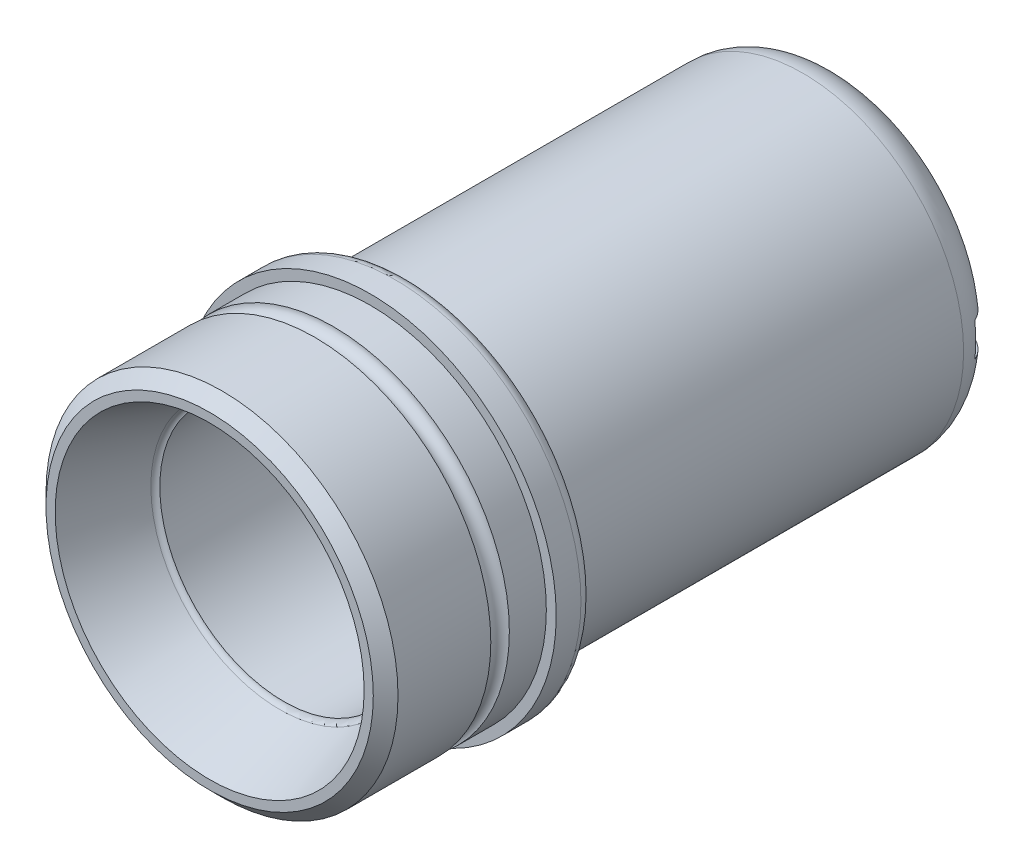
ISO-10303-21;
HEADER;
FILE_DESCRIPTION(('STEP AP214'),'2;1');
FILE_NAME('part.step','',(''),(''),'','','');
FILE_SCHEMA(('AUTOMOTIVE_DESIGN { 1 0 10303 214 1 1 1 1 }'));
ENDSEC;
DATA;
#1=APPLICATION_CONTEXT('core data for automotive mechanical design processes');
#2=APPLICATION_PROTOCOL_DEFINITION('international standard','automotive_design',2000,#1);
#3=PRODUCT_CONTEXT('',#1,'mechanical');
#4=PRODUCT('Part','Part','',(#3));
#5=PRODUCT_RELATED_PRODUCT_CATEGORY('part','',(#4));
#6=PRODUCT_DEFINITION_FORMATION('','',#4);
#7=PRODUCT_DEFINITION_CONTEXT('part definition',#1,'design');
#8=PRODUCT_DEFINITION('design','',#6,#7);
#9=PRODUCT_DEFINITION_SHAPE('','',#8);
#10=(LENGTH_UNIT() NAMED_UNIT(*) SI_UNIT(.MILLI.,.METRE.));
#11=(NAMED_UNIT(*) PLANE_ANGLE_UNIT() SI_UNIT($,.RADIAN.));
#12=(NAMED_UNIT(*) SI_UNIT($,.STERADIAN.) SOLID_ANGLE_UNIT());
#13=UNCERTAINTY_MEASURE_WITH_UNIT(LENGTH_MEASURE(1.E-05),#10,'distance_accuracy_value','');
#14=(GEOMETRIC_REPRESENTATION_CONTEXT(3) GLOBAL_UNCERTAINTY_ASSIGNED_CONTEXT((#13)) GLOBAL_UNIT_ASSIGNED_CONTEXT((#10,
#11,#12)) REPRESENTATION_CONTEXT('',''));
#15=CARTESIAN_POINT('',(0.,0.,0.));
#16=DIRECTION('',(0.,0.,1.));
#17=DIRECTION('',(1.,0.,0.));
#18=AXIS2_PLACEMENT_3D('',#15,#16,#17);
#19=CARTESIAN_POINT('',(0.,9.1186,-80.9625));
#20=DIRECTION('',(0.,0.,1.));
#21=DIRECTION('',(1.,0.,0.));
#22=AXIS2_PLACEMENT_3D('',#19,#20,#21);
#23=PLANE('',#22);
#24=CARTESIAN_POINT('',(0.,0.,-80.9625));
#25=DIRECTION('',(0.,0.,1.));
#26=DIRECTION('',(1.,0.,0.));
#27=AXIS2_PLACEMENT_3D('',#24,#25,#26);
#28=CIRCLE('',#27,15.875);
#29=CARTESIAN_POINT('',(-15.7242155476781,-2.1828125,-80.9625));
#30=VERTEX_POINT('',#29);
#31=CARTESIAN_POINT('',(15.7242155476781,-2.1828125,-80.9625));
#32=VERTEX_POINT('',#31);
#33=EDGE_CURVE('E267',#30,#32,#28,.T.);
#34=ORIENTED_EDGE('',*,*,#33,.F.);
#35=DIRECTION('',(1.,0.,0.));
#36=VECTOR('',#35,1.);
#37=CARTESIAN_POINT('',(-24.13,-2.1828125,-80.9625));
#38=LINE('',#37,#36);
#39=CARTESIAN_POINT('',(-8.85348493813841,-2.1828125,-80.9625));
#40=VERTEX_POINT('',#39);
#41=EDGE_CURVE('E192',#30,#40,#38,.T.);
#42=ORIENTED_EDGE('',*,*,#41,.T.);
#43=CARTESIAN_POINT('',(0.,0.,-80.9625));
#44=DIRECTION('',(0.,0.,1.));
#45=DIRECTION('',(1.,0.,0.));
#46=AXIS2_PLACEMENT_3D('',#43,#44,#45);
#47=CIRCLE('',#46,9.1186);
#48=CARTESIAN_POINT('',(8.85348493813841,-2.1828125,-80.9625));
#49=VERTEX_POINT('',#48);
#50=EDGE_CURVE('E276',#40,#49,#47,.T.);
#51=ORIENTED_EDGE('',*,*,#50,.T.);
#52=EDGE_CURVE('E188',#49,#32,#38,.T.);
#53=ORIENTED_EDGE('',*,*,#52,.T.);
#54=EDGE_LOOP('',(#34,#42,#51,#53));
#55=FACE_BOUND('',#54,.T.);
#56=ADVANCED_FACE('F36',(#55),#23,.F.);
#57=CARTESIAN_POINT('',(0.,0.,0.));
#58=DIRECTION('',(0.,0.,1.));
#59=DIRECTION('',(1.,0.,0.));
#60=AXIS2_PLACEMENT_3D('',#57,#58,#59);
#61=CONICAL_SURFACE('',#60,19.84375,0.349065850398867);
#62=CARTESIAN_POINT('',(0.,0.,-9.01001555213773));
#63=DIRECTION('',(0.,0.,1.));
#64=DIRECTION('',(1.,0.,0.));
#65=AXIS2_PLACEMENT_3D('',#62,#63,#64);
#66=CIRCLE('',#65,16.5643725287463);
#67=CARTESIAN_POINT('',(16.5643725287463,0.,-9.01001555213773));
#68=VERTEX_POINT('',#67);
#69=EDGE_CURVE('E558',#68,#68,#66,.T.);
#70=ORIENTED_EDGE('',*,*,#69,.F.);
#71=EDGE_LOOP('',(#70));
#72=FACE_BOUND('',#71,.T.);
#73=CARTESIAN_POINT('',(0.,0.,0.));
#74=DIRECTION('',(0.,0.,1.));
#75=DIRECTION('',(1.,0.,0.));
#76=AXIS2_PLACEMENT_3D('',#73,#74,#75);
#77=CIRCLE('',#76,19.84375);
#78=CARTESIAN_POINT('',(19.84375,0.,0.));
#79=VERTEX_POINT('',#78);
#80=EDGE_CURVE('E151',#79,#79,#77,.T.);
#81=ORIENTED_EDGE('',*,*,#80,.T.);
#82=EDGE_LOOP('',(#81));
#83=FACE_BOUND('',#82,.T.);
#84=ADVANCED_FACE('F38',(#72,#83),#61,.F.);
#85=CARTESIAN_POINT('',(0.,19.84375,0.));
#86=DIRECTION('',(0.,0.,-1.));
#87=DIRECTION('',(-1.,0.,0.));
#88=AXIS2_PLACEMENT_3D('',#85,#86,#87);
#89=PLANE('',#88);
#90=ORIENTED_EDGE('',*,*,#80,.F.);
#91=EDGE_LOOP('',(#90));
#92=FACE_BOUND('',#91,.T.);
#93=CARTESIAN_POINT('',(0.,0.,0.));
#94=DIRECTION('',(0.,0.,1.));
#95=DIRECTION('',(1.,0.,0.));
#96=AXIS2_PLACEMENT_3D('',#93,#94,#95);
#97=CIRCLE('',#96,21.0185);
#98=CARTESIAN_POINT('',(21.0185,0.,0.));
#99=VERTEX_POINT('',#98);
#100=EDGE_CURVE('E148',#99,#99,#97,.T.);
#101=ORIENTED_EDGE('',*,*,#100,.T.);
#102=EDGE_LOOP('',(#101));
#103=FACE_BOUND('',#102,.T.);
#104=ADVANCED_FACE('F263',(#92,#103),#89,.F.);
#105=CARTESIAN_POINT('',(0.,0.,-1.5875));
#106=DIRECTION('',(0.,0.,-1.));
#107=DIRECTION('',(-1.,0.,0.));
#108=AXIS2_PLACEMENT_3D('',#105,#106,#107);
#109=CONICAL_SURFACE('',#108,22.606,0.785398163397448);
#110=ORIENTED_EDGE('',*,*,#100,.F.);
#111=EDGE_LOOP('',(#110));
#112=FACE_BOUND('',#111,.T.);
#113=CARTESIAN_POINT('',(0.,0.,-1.5875));
#114=DIRECTION('',(0.,0.,1.));
#115=DIRECTION('',(1.,0.,0.));
#116=AXIS2_PLACEMENT_3D('',#113,#114,#115);
#117=CIRCLE('',#116,22.606);
#118=CARTESIAN_POINT('',(22.606,0.,-1.5875));
#119=VERTEX_POINT('',#118);
#120=EDGE_CURVE('E145',#119,#119,#117,.T.);
#121=ORIENTED_EDGE('',*,*,#120,.T.);
#122=EDGE_LOOP('',(#121));
#123=FACE_BOUND('',#122,.T.);
#124=ADVANCED_FACE('F348',(#112,#123),#109,.T.);
#125=CARTESIAN_POINT('',(0.,0.,0.));
#126=DIRECTION('',(0.,0.,1.));
#127=DIRECTION('',(1.,0.,0.));
#128=AXIS2_PLACEMENT_3D('',#125,#126,#127);
#129=CYLINDRICAL_SURFACE('',#128,22.606);
#130=ORIENTED_EDGE('',*,*,#120,.F.);
#131=EDGE_LOOP('',(#130));
#132=FACE_BOUND('',#131,.T.);
#133=CARTESIAN_POINT('',(0.,0.,-13.50645));
#134=DIRECTION('',(0.,0.,1.));
#135=DIRECTION('',(1.,0.,0.));
#136=AXIS2_PLACEMENT_3D('',#133,#134,#135);
#137=CIRCLE('',#136,22.606);
#138=CARTESIAN_POINT('',(22.606,0.,-13.50645));
#139=VERTEX_POINT('',#138);
#140=EDGE_CURVE('E142',#139,#139,#137,.T.);
#141=ORIENTED_EDGE('',*,*,#140,.T.);
#142=EDGE_LOOP('',(#141));
#143=FACE_BOUND('',#142,.T.);
#144=ADVANCED_FACE('F344',(#132,#143),#129,.T.);
#145=CARTESIAN_POINT('',(0.,0.,-14.697075));
#146=DIRECTION('',(0.,0.,1.));
#147=DIRECTION('',(1.,0.,0.));
#148=AXIS2_PLACEMENT_3D('',#145,#146,#147);
#149=TOROIDAL_SURFACE('',#148,22.6219822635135,1.19073226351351);
#150=ORIENTED_EDGE('',*,*,#140,.F.);
#151=EDGE_LOOP('',(#150));
#152=FACE_BOUND('',#151,.T.);
#153=CARTESIAN_POINT('',(0.,0.,-15.8877));
#154=DIRECTION('',(0.,0.,1.));
#155=DIRECTION('',(1.,0.,0.));
#156=AXIS2_PLACEMENT_3D('',#153,#154,#155);
#157=CIRCLE('',#156,22.606);
#158=CARTESIAN_POINT('',(22.606,0.,-15.8877));
#159=VERTEX_POINT('',#158);
#160=EDGE_CURVE('E133',#159,#159,#157,.T.);
#161=ORIENTED_EDGE('',*,*,#160,.T.);
#162=EDGE_LOOP('',(#161));
#163=FACE_BOUND('',#162,.T.);
#164=ADVANCED_FACE('F340',(#152,#163),#149,.F.);
#165=CARTESIAN_POINT('',(0.,0.,0.));
#166=DIRECTION('',(0.,0.,1.));
#167=DIRECTION('',(1.,0.,0.));
#168=AXIS2_PLACEMENT_3D('',#165,#166,#167);
#169=CYLINDRICAL_SURFACE('',#168,22.606);
#170=ORIENTED_EDGE('',*,*,#160,.F.);
#171=EDGE_LOOP('',(#170));
#172=FACE_BOUND('',#171,.T.);
#173=CARTESIAN_POINT('',(0.,0.,-20.6375));
#174=DIRECTION('',(0.,0.,1.));
#175=DIRECTION('',(1.,0.,0.));
#176=AXIS2_PLACEMENT_3D('',#173,#174,#175);
#177=CIRCLE('',#176,22.606);
#178=CARTESIAN_POINT('',(-22.5501902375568,-1.5875,-20.6375));
#179=VERTEX_POINT('',#178);
#180=CARTESIAN_POINT('',(-22.5501902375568,1.5875,-20.6375));
#181=VERTEX_POINT('',#180);
#182=EDGE_CURVE('E126',#179,#181,#177,.T.);
#183=ORIENTED_EDGE('',*,*,#182,.T.);
#184=CARTESIAN_POINT('',(-22.5501902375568,1.5875,-20.6375));
#185=CARTESIAN_POINT('',(-22.550189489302,1.58749976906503,-20.5928957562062));
#186=CARTESIAN_POINT('',(-22.5503227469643,1.58561894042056,-20.5483129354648));
#187=CARTESIAN_POINT('',(-22.5508493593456,1.57811597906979,-20.4594673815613));
#188=CARTESIAN_POINT('',(-22.5512426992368,1.57249405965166,-20.4152046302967));
#189=CARTESIAN_POINT('',(-22.5527992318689,1.55007157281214,-20.2834538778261));
#190=CARTESIAN_POINT('',(-22.5543389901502,1.52771412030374,-20.1968501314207));
#191=CARTESIAN_POINT('',(-22.5582511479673,1.46880970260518,-20.0286404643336));
#192=CARTESIAN_POINT('',(-22.5606238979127,1.43225676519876,-19.9470366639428));
#193=CARTESIAN_POINT('',(-22.5659336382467,1.34600691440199,-19.7911237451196));
#194=CARTESIAN_POINT('',(-22.5688705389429,1.29631208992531,-19.7168134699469));
#195=CARTESIAN_POINT('',(-22.5749835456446,1.18509524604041,-19.5774688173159));
#196=CARTESIAN_POINT('',(-22.5781600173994,1.1235549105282,-19.5124490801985));
#197=CARTESIAN_POINT('',(-22.5843912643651,0.990423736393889,-19.3936441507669));
#198=CARTESIAN_POINT('',(-22.5874460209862,0.918831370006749,-19.3398606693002));
#199=CARTESIAN_POINT('',(-22.5930926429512,0.767546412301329,-19.245017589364));
#200=CARTESIAN_POINT('',(-22.5956840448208,0.687845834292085,-19.2039707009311));
#201=CARTESIAN_POINT('',(-22.600107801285,0.522667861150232,-19.1358493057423));
#202=CARTESIAN_POINT('',(-22.6019402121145,0.437190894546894,-19.1087737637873));
#203=CARTESIAN_POINT('',(-22.6046371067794,0.263031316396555,-19.0694030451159));
#204=CARTESIAN_POINT('',(-22.6055031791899,0.174354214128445,-19.0570836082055));
#205=CARTESIAN_POINT('',(-22.6061751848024,-0.00381533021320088,-19.047499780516));
#206=CARTESIAN_POINT('',(-22.6059811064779,-0.0933077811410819,-19.0502355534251));
#207=CARTESIAN_POINT('',(-22.6045559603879,-0.270398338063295,-19.0706650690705));
#208=CARTESIAN_POINT('',(-22.6033267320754,-0.357999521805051,-19.0883322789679));
#209=CARTESIAN_POINT('',(-22.5999717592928,-0.528989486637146,-19.1380819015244));
#210=CARTESIAN_POINT('',(-22.5978460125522,-0.612378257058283,-19.1701643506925));
#211=CARTESIAN_POINT('',(-22.5929340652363,-0.772663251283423,-19.2478643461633));
#212=CARTESIAN_POINT('',(-22.5901472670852,-0.849553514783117,-19.2934941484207));
#213=CARTESIAN_POINT('',(-22.5842268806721,-0.994589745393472,-19.3969825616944));
#214=CARTESIAN_POINT('',(-22.5810933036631,-1.06273599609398,-19.4548407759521));
#215=CARTESIAN_POINT('',(-22.5748241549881,-1.18849978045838,-19.5812839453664));
#216=CARTESIAN_POINT('',(-22.5716885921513,-1.24609569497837,-19.6498904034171));
#217=CARTESIAN_POINT('',(-22.5657743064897,-1.34897406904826,-19.7958370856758));
#218=CARTESIAN_POINT('',(-22.5629956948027,-1.39425269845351,-19.8731800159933));
#219=CARTESIAN_POINT('',(-22.5581088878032,-1.47120804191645,-20.034428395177));
#220=CARTESIAN_POINT('',(-22.5560011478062,-1.50287552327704,-20.1183382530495));
#221=CARTESIAN_POINT('',(-22.5527009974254,-1.55161868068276,-20.2902379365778));
#222=CARTESIAN_POINT('',(-22.5515071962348,-1.56871653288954,-20.378221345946));
#223=CARTESIAN_POINT('',(-22.5506208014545,-1.58137299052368,-20.4952540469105));
#224=CARTESIAN_POINT('',(-22.5504594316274,-1.58367179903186,-20.5236795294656));
#225=CARTESIAN_POINT('',(-22.5502442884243,-1.58673321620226,-20.5805661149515));
#226=CARTESIAN_POINT('',(-22.5501903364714,-1.58749837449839,-20.609027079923));
#227=CARTESIAN_POINT('',(-22.5501902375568,-1.5875,-20.6375));
#228=B_SPLINE_CURVE_WITH_KNOTS('',3,(#184,#185,#186,#187,#188,#189,#190,#191,#192,#193,#194,
#195,#196,#197,#198,#199,#200,#201,#202,#203,#204,#205,#206,#207,#208,#209,#210,#211,#212,#213,
#214,#215,#216,#217,#218,#219,#220,#221,#222,#223,#224,#225,#226,#227),.UNSPECIFIED.,.F.,.F.,(4,
2,2,2,2,2,2,2,2,2,2,2,2,2,2,2,2,2,2,2,2,4),(0.,0.133730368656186,0.267453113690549,
0.534444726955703,0.801548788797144,1.06861041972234,1.33608836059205,1.6036069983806,
1.87139174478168,2.13915664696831,2.40648071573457,2.67380769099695,2.94066062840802,
3.20751424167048,3.47461001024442,3.74169711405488,4.00932554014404,4.27703709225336,
4.5449299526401,4.812414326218,4.89794115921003,4.98332568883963),.UNSPECIFIED.);
#229=EDGE_CURVE('E201',#181,#179,#228,.T.);
#230=ORIENTED_EDGE('',*,*,#229,.T.);
#231=EDGE_LOOP('',(#183,#230));
#232=FACE_BOUND('',#231,.T.);
#233=ADVANCED_FACE('F335',(#172,#232),#169,.T.);
#234=CARTESIAN_POINT('',(0.,23.876,-20.6375));
#235=DIRECTION('',(0.,0.,-1.));
#236=DIRECTION('',(-1.,0.,0.));
#237=AXIS2_PLACEMENT_3D('',#234,#235,#236);
#238=PLANE('',#237);
#239=CARTESIAN_POINT('',(0.,0.,-20.6375));
#240=DIRECTION('',(0.,0.,1.));
#241=DIRECTION('',(1.,0.,0.));
#242=AXIS2_PLACEMENT_3D('',#239,#240,#241);
#243=CIRCLE('',#242,23.876);
#244=CARTESIAN_POINT('',(-23.823165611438,-1.5875,-20.6375));
#245=VERTEX_POINT('',#244);
#246=CARTESIAN_POINT('',(-23.823165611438,1.5875,-20.6375));
#247=VERTEX_POINT('',#246);
#248=EDGE_CURVE('E124',#245,#247,#243,.T.);
#249=ORIENTED_EDGE('',*,*,#248,.T.);
#250=DIRECTION('',(1.,0.,0.));
#251=VECTOR('',#250,1.);
#252=CARTESIAN_POINT('',(-16.7187956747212,1.5875,-20.6375));
#253=LINE('',#252,#251);
#254=EDGE_CURVE('E56',#247,#181,#253,.T.);
#255=ORIENTED_EDGE('',*,*,#254,.T.);
#256=ORIENTED_EDGE('',*,*,#182,.F.);
#257=DIRECTION('',(1.,0.,0.));
#258=VECTOR('',#257,1.);
#259=CARTESIAN_POINT('',(-16.7187956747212,-1.5875,-20.6375));
#260=LINE('',#259,#258);
#261=EDGE_CURVE('E116',#179,#245,#260,.F.);
#262=ORIENTED_EDGE('',*,*,#261,.T.);
#263=EDGE_LOOP('',(#249,#255,#256,#262));
#264=FACE_BOUND('',#263,.T.);
#265=ADVANCED_FACE('F123',(#264),#238,.F.);
#266=CARTESIAN_POINT('',(0.,0.,0.));
#267=DIRECTION('',(0.,0.,1.));
#268=DIRECTION('',(1.,0.,0.));
#269=AXIS2_PLACEMENT_3D('',#266,#267,#268);
#270=CYLINDRICAL_SURFACE('',#269,23.876);
#271=ORIENTED_EDGE('',*,*,#248,.F.);
#272=CARTESIAN_POINT('',(-23.823165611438,-1.5875,-20.6375));
#273=CARTESIAN_POINT('',(-23.8231649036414,-1.58749976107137,-20.682110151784));
#274=CARTESIAN_POINT('',(-23.8232910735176,-1.58561844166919,-20.726698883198));
#275=CARTESIAN_POINT('',(-23.8237896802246,-1.57811347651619,-20.8155563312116));
#276=CARTESIAN_POINT('',(-23.8241621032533,-1.57249004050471,-20.8598250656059));
#277=CARTESIAN_POINT('',(-23.8256358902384,-1.5500611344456,-20.9915953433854));
#278=CARTESIAN_POINT('',(-23.8270938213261,-1.52769691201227,-21.0782126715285));
#279=CARTESIAN_POINT('',(-23.8307982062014,-1.46877292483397,-21.2464508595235));
#280=CARTESIAN_POINT('',(-23.8330450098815,-1.43220686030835,-21.3280694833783));
#281=CARTESIAN_POINT('',(-23.838072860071,-1.34592653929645,-21.4840056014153));
#282=CARTESIAN_POINT('',(-23.8408537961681,-1.29621499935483,-21.5583245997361));
#283=CARTESIAN_POINT('',(-23.8466414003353,-1.1849754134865,-21.6976648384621));
#284=CARTESIAN_POINT('',(-23.8496483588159,-1.12343200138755,-21.7626737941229));
#285=CARTESIAN_POINT('',(-23.8555476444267,-0.990279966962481,-21.8814709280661));
#286=CARTESIAN_POINT('',(-23.8584399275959,-0.918667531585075,-21.9352548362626));
#287=CARTESIAN_POINT('',(-23.8637868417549,-0.767326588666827,-22.0301073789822));
#288=CARTESIAN_POINT('',(-23.8662408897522,-0.687587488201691,-22.0711591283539));
#289=CARTESIAN_POINT('',(-23.8704269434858,-0.5223911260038,-22.1392414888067));
#290=CARTESIAN_POINT('',(-23.8721597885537,-0.436940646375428,-22.1662884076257));
#291=CARTESIAN_POINT('',(-23.8742773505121,-0.292516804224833,-22.1989277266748));
#292=CARTESIAN_POINT('',(-23.8749203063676,-0.23445565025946,-22.2086915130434));
#293=CARTESIAN_POINT('',(-23.8757818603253,-0.117604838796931,-22.2217289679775));
#294=CARTESIAN_POINT('',(-23.8760004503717,-0.0588151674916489,-22.2250025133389));
#295=CARTESIAN_POINT('',(-23.8759993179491,0.0890707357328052,-22.2249961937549));
#296=CARTESIAN_POINT('',(-23.8754962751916,0.178199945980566,-22.2174788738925));
#297=CARTESIAN_POINT('',(-23.8735380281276,0.353990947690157,-22.1876006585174));
#298=CARTESIAN_POINT('',(-23.8720817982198,0.440649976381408,-22.165223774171));
#299=CARTESIAN_POINT('',(-23.8683818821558,0.608936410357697,-22.1062730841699));
#300=CARTESIAN_POINT('',(-23.8661385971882,0.690566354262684,-22.0697065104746));
#301=CARTESIAN_POINT('',(-23.8611166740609,0.846511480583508,-21.9834253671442));
#302=CARTESIAN_POINT('',(-23.8583381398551,0.920828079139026,-21.9337133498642));
#303=CARTESIAN_POINT('',(-23.8525529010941,1.06017674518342,-21.8224647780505));
#304=CARTESIAN_POINT('',(-23.8495458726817,1.12519524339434,-21.7609112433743));
#305=CARTESIAN_POINT('',(-23.8436451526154,1.24398896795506,-21.6277564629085));
#306=CARTESIAN_POINT('',(-23.84075147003,1.2977632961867,-21.5561544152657));
#307=CARTESIAN_POINT('',(-23.8354007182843,1.39259291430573,-21.4048492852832));
#308=CARTESIAN_POINT('',(-23.8329441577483,1.43363342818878,-21.3251369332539));
#309=CARTESIAN_POINT('',(-23.8287508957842,1.50172493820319,-21.1599441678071));
#310=CARTESIAN_POINT('',(-23.8270138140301,1.52878332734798,-21.0744668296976));
#311=CARTESIAN_POINT('',(-23.8248915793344,1.56143706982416,-20.9299730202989));
#312=CARTESIAN_POINT('',(-23.8242474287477,1.57120457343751,-20.8718688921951));
#313=CARTESIAN_POINT('',(-23.82338319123,1.58423526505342,-20.7550180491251));
#314=CARTESIAN_POINT('',(-23.8231624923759,1.58750783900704,-20.6962723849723));
#315=CARTESIAN_POINT('',(-23.823165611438,1.5875,-20.6375));
#316=B_SPLINE_CURVE_WITH_KNOTS('',3,(#272,#273,#274,#275,#276,#277,#278,#279,#280,#281,#282,
#283,#284,#285,#286,#287,#288,#289,#290,#291,#292,#293,#294,#295,#296,#297,#298,#299,#300,#301,
#302,#303,#304,#305,#306,#307,#308,#309,#310,#311,#312,#313,#314,#315),.UNSPECIFIED.,.F.,.F.,(4,
2,2,2,2,2,2,2,2,2,2,2,2,2,2,2,2,2,2,2,2,4),(0.,0.133748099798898,0.267488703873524,
0.534520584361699,0.801671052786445,1.06876635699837,1.33621091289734,1.60375702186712,
1.87165644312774,2.13924320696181,2.31554387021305,2.49184788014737,2.75884580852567,
3.02613149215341,3.2932811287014,3.56037893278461,3.82786263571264,4.09536769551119,
4.36318201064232,4.63085457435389,4.80728352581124,4.98345733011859),.UNSPECIFIED.);
#317=EDGE_CURVE('E11',#245,#247,#316,.T.);
#318=ORIENTED_EDGE('',*,*,#317,.T.);
#319=EDGE_LOOP('',(#271,#318));
#320=FACE_BOUND('',#319,.T.);
#321=CARTESIAN_POINT('',(0.,0.,-23.8125));
#322=DIRECTION('',(0.,0.,1.));
#323=DIRECTION('',(1.,0.,0.));
#324=AXIS2_PLACEMENT_3D('',#321,#322,#323);
#325=CIRCLE('',#324,23.876);
#326=CARTESIAN_POINT('',(23.876,0.,-23.8125));
#327=VERTEX_POINT('',#326);
#328=EDGE_CURVE('E131',#327,#327,#325,.T.);
#329=ORIENTED_EDGE('',*,*,#328,.T.);
#330=EDGE_LOOP('',(#329));
#331=FACE_BOUND('',#330,.T.);
#332=ADVANCED_FACE('F129',(#320,#331),#270,.T.);
#333=CARTESIAN_POINT('',(0.,0.,-23.8125));
#334=DIRECTION('',(0.,0.,1.));
#335=DIRECTION('',(1.,0.,0.));
#336=AXIS2_PLACEMENT_3D('',#333,#334,#335);
#337=TOROIDAL_SURFACE('',#336,22.2885,1.5875);
#338=ORIENTED_EDGE('',*,*,#328,.F.);
#339=EDGE_LOOP('',(#338));
#340=FACE_BOUND('',#339,.T.);
#341=CARTESIAN_POINT('',(0.,0.,-25.4));
#342=DIRECTION('',(0.,0.,1.));
#343=DIRECTION('',(1.,0.,0.));
#344=AXIS2_PLACEMENT_3D('',#341,#342,#343);
#345=CIRCLE('',#344,22.2885);
#346=CARTESIAN_POINT('',(22.2885,0.,-25.4));
#347=VERTEX_POINT('',#346);
#348=EDGE_CURVE('E136',#347,#347,#345,.T.);
#349=ORIENTED_EDGE('',*,*,#348,.T.);
#350=EDGE_LOOP('',(#349));
#351=FACE_BOUND('',#350,.T.);
#352=ADVANCED_FACE('F290',(#340,#351),#337,.T.);
#353=CARTESIAN_POINT('',(0.,21.43125,-25.4));
#354=DIRECTION('',(0.,0.,1.));
#355=DIRECTION('',(1.,0.,0.));
#356=AXIS2_PLACEMENT_3D('',#353,#354,#355);
#357=PLANE('',#356);
#358=ORIENTED_EDGE('',*,*,#348,.F.);
#359=EDGE_LOOP('',(#358));
#360=FACE_BOUND('',#359,.T.);
#361=CARTESIAN_POINT('',(0.,0.,-25.4));
#362=DIRECTION('',(0.,0.,1.));
#363=DIRECTION('',(1.,0.,0.));
#364=AXIS2_PLACEMENT_3D('',#361,#362,#363);
#365=CIRCLE('',#364,21.43125);
#366=CARTESIAN_POINT('',(21.43125,0.,-25.4));
#367=VERTEX_POINT('',#366);
#368=EDGE_CURVE('E285',#367,#367,#365,.T.);
#369=ORIENTED_EDGE('',*,*,#368,.T.);
#370=EDGE_LOOP('',(#369));
#371=FACE_BOUND('',#370,.T.);
#372=ADVANCED_FACE('F292',(#360,#371),#357,.F.);
#373=CARTESIAN_POINT('',(0.,0.,-26.19375));
#374=DIRECTION('',(0.,0.,1.));
#375=DIRECTION('',(1.,0.,0.));
#376=AXIS2_PLACEMENT_3D('',#373,#374,#375);
#377=TOROIDAL_SURFACE('',#376,21.43125,0.793749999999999);
#378=ORIENTED_EDGE('',*,*,#368,.F.);
#379=EDGE_LOOP('',(#378));
#380=FACE_BOUND('',#379,.T.);
#381=CARTESIAN_POINT('',(0.,0.,-26.19375));
#382=DIRECTION('',(0.,0.,1.));
#383=DIRECTION('',(1.,0.,0.));
#384=AXIS2_PLACEMENT_3D('',#381,#382,#383);
#385=CIRCLE('',#384,20.6375);
#386=CARTESIAN_POINT('',(20.6375,0.,-26.19375));
#387=VERTEX_POINT('',#386);
#388=EDGE_CURVE('E282',#387,#387,#385,.T.);
#389=ORIENTED_EDGE('',*,*,#388,.T.);
#390=EDGE_LOOP('',(#389));
#391=FACE_BOUND('',#390,.T.);
#392=ADVANCED_FACE('F295',(#380,#391),#377,.F.);
#393=CARTESIAN_POINT('',(0.,0.,0.));
#394=DIRECTION('',(0.,0.,1.));
#395=DIRECTION('',(1.,0.,0.));
#396=AXIS2_PLACEMENT_3D('',#393,#394,#395);
#397=CYLINDRICAL_SURFACE('',#396,20.6375);
#398=ORIENTED_EDGE('',*,*,#388,.F.);
#399=EDGE_LOOP('',(#398));
#400=FACE_BOUND('',#399,.T.);
#401=CARTESIAN_POINT('',(0.,0.,-76.2));
#402=DIRECTION('',(0.,0.,1.));
#403=DIRECTION('',(1.,0.,0.));
#404=AXIS2_PLACEMENT_3D('',#401,#402,#403);
#405=CIRCLE('',#404,20.6375);
#406=CARTESIAN_POINT('',(20.6375,0.,-76.2));
#407=VERTEX_POINT('',#406);
#408=EDGE_CURVE('E275',#407,#407,#405,.T.);
#409=ORIENTED_EDGE('',*,*,#408,.T.);
#410=EDGE_LOOP('',(#409));
#411=FACE_BOUND('',#410,.T.);
#412=ADVANCED_FACE('F255',(#400,#411),#397,.T.);
#413=CARTESIAN_POINT('',(0.,0.,-76.2));
#414=DIRECTION('',(0.,0.,1.));
#415=DIRECTION('',(1.,0.,0.));
#416=AXIS2_PLACEMENT_3D('',#413,#414,#415);
#417=TOROIDAL_SURFACE('',#416,15.875,4.7625);
#418=ORIENTED_EDGE('',*,*,#408,.F.);
#419=EDGE_LOOP('',(#418));
#420=FACE_BOUND('',#419,.T.);
#421=CARTESIAN_POINT('',(0.,0.,-78.184375));
#422=DIRECTION('',(0.,0.,1.));
#423=DIRECTION('',(1.,0.,0.));
#424=AXIS2_PLACEMENT_3D('',#421,#422,#423);
#425=CIRCLE('',#424,20.2043951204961);
#426=CARTESIAN_POINT('',(-20.0861373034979,2.1828125,-78.184375));
#427=VERTEX_POINT('',#426);
#428=CARTESIAN_POINT('',(-20.0861373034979,-2.1828125,-78.184375));
#429=VERTEX_POINT('',#428);
#430=EDGE_CURVE('E307',#427,#429,#425,.T.);
#431=ORIENTED_EDGE('',*,*,#430,.T.);
#432=CARTESIAN_POINT('',(-19.2253017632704,-2.1828125,-79.4579087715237));
#433=CARTESIAN_POINT('',(-19.1328230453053,-2.1828125,-79.5558880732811));
#434=CARTESIAN_POINT('',(-19.0361995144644,-2.1828125,-79.6499359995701));
#435=CARTESIAN_POINT('',(-18.8353185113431,-2.1828125,-79.8295614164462));
#436=CARTESIAN_POINT('',(-18.7310589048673,-2.1828125,-79.9151365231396));
#437=CARTESIAN_POINT('',(-18.5155902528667,-2.1828125,-80.0772599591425));
#438=CARTESIAN_POINT('',(-18.4043746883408,-2.1828125,-80.1537996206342));
#439=CARTESIAN_POINT('',(-18.1758449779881,-2.1828125,-80.2972575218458));
#440=CARTESIAN_POINT('',(-18.0585285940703,-2.1828125,-80.3641721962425));
#441=CARTESIAN_POINT('',(-17.8188212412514,-2.1828125,-80.4878165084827));
#442=CARTESIAN_POINT('',(-17.6964363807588,-2.1828125,-80.544557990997));
#443=CARTESIAN_POINT('',(-17.447291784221,-2.1828125,-80.6475905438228));
#444=CARTESIAN_POINT('',(-17.3205304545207,-2.1828125,-80.6938777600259));
#445=CARTESIAN_POINT('',(-17.0636564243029,-2.1828125,-80.7756444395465));
#446=CARTESIAN_POINT('',(-16.9335458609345,-2.1828125,-80.8111306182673));
#447=CARTESIAN_POINT('',(-16.6707664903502,-2.1828125,-80.8711177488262));
#448=CARTESIAN_POINT('',(-16.5380967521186,-2.1828125,-80.8956146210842));
#449=CARTESIAN_POINT('',(-16.2704666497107,-2.1828125,-80.9335538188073));
#450=CARTESIAN_POINT('',(-16.1354978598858,-2.1828125,-80.9469367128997));
#451=CARTESIAN_POINT('',(-15.8648643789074,-2.1828125,-80.9623565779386));
#452=CARTESIAN_POINT('',(-15.7291994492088,-2.1828125,-80.964389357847));
#453=CARTESIAN_POINT('',(-15.4582145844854,-2.1828125,-80.9571017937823));
#454=CARTESIAN_POINT('',(-15.3228945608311,-2.1828125,-80.9477847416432));
#455=CARTESIAN_POINT('',(-15.0534560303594,-2.1828125,-80.9178768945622));
#456=CARTESIAN_POINT('',(-14.9193379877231,-2.1828125,-80.8972819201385));
#457=CARTESIAN_POINT('',(-14.6524113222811,-2.1828125,-80.8447958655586));
#458=CARTESIAN_POINT('',(-14.5196171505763,-2.1828125,-80.8128312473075));
#459=CARTESIAN_POINT('',(-14.2571360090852,-2.1828125,-80.7378505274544));
#460=CARTESIAN_POINT('',(-14.1274502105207,-2.1828125,-80.69483032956));
#461=CARTESIAN_POINT('',(-13.8721869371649,-2.1828125,-80.5980552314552));
#462=CARTESIAN_POINT('',(-13.7466080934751,-2.1828125,-80.5443039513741));
#463=CARTESIAN_POINT('',(-13.5003953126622,-2.1828125,-80.426440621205));
#464=CARTESIAN_POINT('',(-13.3797632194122,-2.1828125,-80.3623247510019));
#465=CARTESIAN_POINT('',(-13.0260939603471,-2.1828125,-80.1547339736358));
#466=CARTESIAN_POINT('',(-12.8016691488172,-2.1828125,-79.9961622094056));
#467=CARTESIAN_POINT('',(-12.3829539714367,-2.1828125,-79.6434527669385));
#468=CARTESIAN_POINT('',(-12.1886630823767,-2.1828125,-79.4493157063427));
#469=CARTESIAN_POINT('',(-11.8370386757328,-2.1828125,-79.0321075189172));
#470=CARTESIAN_POINT('',(-11.6794774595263,-2.1828125,-78.8092287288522));
#471=CARTESIAN_POINT('',(-11.4047143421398,-2.1828125,-78.3398492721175));
#472=CARTESIAN_POINT('',(-11.2875085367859,-2.1828125,-78.0933508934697));
#473=CARTESIAN_POINT('',(-11.0987840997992,-2.1828125,-77.5878449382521));
#474=CARTESIAN_POINT('',(-11.0265776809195,-2.1828125,-77.3290942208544));
#475=CARTESIAN_POINT('',(-10.9273959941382,-2.1828125,-76.8030718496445));
#476=CARTESIAN_POINT('',(-10.9004157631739,-2.1828125,-76.5358011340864));
#477=CARTESIAN_POINT('',(-10.8926560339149,-2.1828125,-76.0047133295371));
#478=CARTESIAN_POINT('',(-10.9111732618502,-2.1828125,-75.7409062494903));
#479=CARTESIAN_POINT('',(-10.9923174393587,-2.1828125,-75.2201760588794));
#480=CARTESIAN_POINT('',(-11.0549436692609,-2.1828125,-74.963252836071));
#481=CARTESIAN_POINT('',(-11.2221426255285,-2.1828125,-74.4638736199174));
#482=CARTESIAN_POINT('',(-11.3266547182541,-2.1828125,-74.2213972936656));
#483=CARTESIAN_POINT('',(-11.5743679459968,-2.1828125,-73.7570948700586));
#484=CARTESIAN_POINT('',(-11.7175716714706,-2.1828125,-73.5352701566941));
#485=CARTESIAN_POINT('',(-12.0406232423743,-2.1828125,-73.1152753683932));
#486=CARTESIAN_POINT('',(-12.2209453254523,-2.1828125,-72.9174701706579));
#487=CARTESIAN_POINT('',(-12.6117526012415,-2.1828125,-72.5543231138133));
#488=CARTESIAN_POINT('',(-12.8222404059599,-2.1828125,-72.3889840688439));
#489=CARTESIAN_POINT('',(-13.2711868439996,-2.1828125,-72.0926608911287));
#490=CARTESIAN_POINT('',(-13.5100504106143,-2.1828125,-71.9622899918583));
#491=CARTESIAN_POINT('',(-14.0061394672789,-2.1828125,-71.7430974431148));
#492=CARTESIAN_POINT('',(-14.2633659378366,-2.1828125,-71.6542780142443));
#493=CARTESIAN_POINT('',(-14.7912876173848,-2.1828125,-71.5200764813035));
#494=CARTESIAN_POINT('',(-15.0620798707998,-2.1828125,-71.4750756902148));
#495=CARTESIAN_POINT('',(-15.6073816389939,-2.1828125,-71.4312111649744));
#496=CARTESIAN_POINT('',(-15.8818911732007,-2.1828125,-71.4323476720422));
#497=CARTESIAN_POINT('',(-16.4265702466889,-2.1828125,-71.4808408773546));
#498=CARTESIAN_POINT('',(-16.6967432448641,-2.1828125,-71.5281586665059));
#499=CARTESIAN_POINT('',(-17.2252168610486,-2.1828125,-71.6677843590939));
#500=CARTESIAN_POINT('',(-17.4835178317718,-2.1828125,-71.760090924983));
#501=CARTESIAN_POINT('',(-17.9791073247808,-2.1828125,-71.9864356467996));
#502=CARTESIAN_POINT('',(-18.2165192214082,-2.1828125,-72.1202042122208));
#503=CARTESIAN_POINT('',(-18.6653749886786,-2.1828125,-72.4261140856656));
#504=CARTESIAN_POINT('',(-18.8768198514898,-2.1828125,-72.5982539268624));
#505=CARTESIAN_POINT('',(-19.1688503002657,-2.1828125,-72.8805627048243));
#506=CARTESIAN_POINT('',(-19.2617357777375,-2.1828125,-72.9783162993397));
#507=CARTESIAN_POINT('',(-19.4388891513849,-2.1828125,-73.1813251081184));
#508=CARTESIAN_POINT('',(-19.5231603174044,-2.1828125,-73.2865774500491));
#509=CARTESIAN_POINT('',(-19.6824936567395,-2.1828125,-73.5038814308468));
#510=CARTESIAN_POINT('',(-19.7575525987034,-2.1828125,-73.6159354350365));
#511=CARTESIAN_POINT('',(-19.8978579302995,-2.1828125,-73.8459723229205));
#512=CARTESIAN_POINT('',(-19.9631080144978,-2.1828125,-73.9639529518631));
#513=CARTESIAN_POINT('',(-20.082979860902,-2.1828125,-74.2043028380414));
#514=CARTESIAN_POINT('',(-20.1376635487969,-2.1828125,-74.3266412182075));
#515=CARTESIAN_POINT('',(-20.2364721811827,-2.1828125,-74.5754572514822));
#516=CARTESIAN_POINT('',(-20.2806011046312,-2.1828125,-74.7019333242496));
#517=CARTESIAN_POINT('',(-20.3580147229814,-2.1828125,-74.958205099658));
#518=CARTESIAN_POINT('',(-20.3912960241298,-2.1828125,-75.0880018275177));
#519=CARTESIAN_POINT('',(-20.4467403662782,-2.1828125,-75.3498982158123));
#520=CARTESIAN_POINT('',(-20.4689075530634,-2.1828125,-75.4819969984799));
#521=CARTESIAN_POINT('',(-20.5019169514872,-2.1828125,-75.747097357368));
#522=CARTESIAN_POINT('',(-20.5128014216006,-2.1828125,-75.8800936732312));
#523=CARTESIAN_POINT('',(-20.5233106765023,-2.1828125,-76.1464808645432));
#524=CARTESIAN_POINT('',(-20.5229396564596,-2.1828125,-76.2798715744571));
#525=CARTESIAN_POINT('',(-20.5109472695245,-2.1828125,-76.5462281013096));
#526=CARTESIAN_POINT('',(-20.4993190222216,-2.1828125,-76.6791936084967));
#527=CARTESIAN_POINT('',(-20.4648935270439,-2.1828125,-76.9436208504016));
#528=CARTESIAN_POINT('',(-20.44210039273,-2.1828125,-77.0750831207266));
#529=CARTESIAN_POINT('',(-20.3855228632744,-2.1828125,-77.3355746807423));
#530=CARTESIAN_POINT('',(-20.3517421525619,-2.1828125,-77.4646047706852));
#531=CARTESIAN_POINT('',(-20.273448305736,-2.1828125,-77.7193143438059));
#532=CARTESIAN_POINT('',(-20.2289390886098,-2.1828125,-77.8449950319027));
#533=CARTESIAN_POINT('',(-20.1295489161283,-2.1828125,-78.0920555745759));
#534=CARTESIAN_POINT('',(-20.074677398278,-2.1828125,-78.2134392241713));
#535=CARTESIAN_POINT('',(-19.9549556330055,-2.1828125,-78.4511317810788));
#536=CARTESIAN_POINT('',(-19.8901080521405,-2.1828125,-78.5674420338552));
#537=CARTESIAN_POINT('',(-19.7349910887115,-2.1828125,-78.8200990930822));
#538=CARTESIAN_POINT('',(-19.642296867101,-2.1828125,-78.9549656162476));
#539=CARTESIAN_POINT('',(-19.4435347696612,-2.1828125,-79.2144521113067));
#540=CARTESIAN_POINT('',(-19.3374669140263,-2.1828125,-79.3390720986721));
#541=CARTESIAN_POINT('',(-19.2253017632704,-2.1828125,-79.4579087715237));
#542=B_SPLINE_CURVE_WITH_KNOTS('',3,(#432,#433,#434,#435,#436,#437,#438,#439,#440,#441,#442,
#443,#444,#445,#446,#447,#448,#449,#450,#451,#452,#453,#454,#455,#456,#457,#458,#459,#460,#461,
#462,#463,#464,#465,#466,#467,#468,#469,#470,#471,#472,#473,#474,#475,#476,#477,#478,#479,#480,
#481,#482,#483,#484,#485,#486,#487,#488,#489,#490,#491,#492,#493,#494,#495,#496,#497,#498,#499,
#500,#501,#502,#503,#504,#505,#506,#507,#508,#509,#510,#511,#512,#513,#514,#515,#516,#517,#518,
#519,#520,#521,#522,#523,#524,#525,#526,#527,#528,#529,#530,#531,#532,#533,#534,#535,#536,#537,
#538,#539,#540,#541),.UNSPECIFIED.,.T.,.F.,(4,2,2,2,2,2,2,2,2,2,2,2,2,2,2,2,2,2,2,2,2,2,2,2,2,2,
2,2,2,2,2,2,2,2,2,2,2,2,2,2,2,2,2,2,2,2,2,2,2,2,2,2,2,2,4),(0.,0.404046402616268,
0.808206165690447,1.21275054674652,1.61744439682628,2.02166395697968,2.42603229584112,
2.83014870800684,3.23441501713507,3.64082944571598,4.04739393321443,4.45384053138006,
4.86043785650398,5.26971433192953,5.67914267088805,6.08843312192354,6.4978747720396,
7.31797903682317,8.1380690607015,8.9529312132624,9.76771451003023,10.5697175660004,
11.3716326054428,12.1612303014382,12.9508151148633,13.7392610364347,14.5277597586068,
15.3270390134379,16.1263875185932,16.9389526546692,17.7515612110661,18.5711795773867,
19.3908022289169,20.2097349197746,21.0286432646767,21.8423348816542,22.6559953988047,
23.0601376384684,23.4641258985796,23.8682554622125,24.272232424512,24.6737648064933,
25.0751455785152,25.4766518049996,25.8780081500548,26.2778557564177,26.6775543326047,
27.0774973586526,27.4772931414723,27.8769550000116,28.2764710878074,28.6756250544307,
29.074672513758,29.5647311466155,30.054789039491),.UNSPECIFIED.);
#543=EDGE_CURVE('E187',#429,#30,#542,.T.);
#544=ORIENTED_EDGE('',*,*,#543,.T.);
#545=ORIENTED_EDGE('',*,*,#33,.T.);
#546=CARTESIAN_POINT('',(12.0085508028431,-2.1828125,-79.2356042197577));
#547=CARTESIAN_POINT('',(12.0961171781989,-2.1828125,-79.3397555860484));
#548=CARTESIAN_POINT('',(12.1881078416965,-2.1828125,-79.4401718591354));
#549=CARTESIAN_POINT('',(12.3802867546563,-2.1828125,-79.6328946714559));
#550=CARTESIAN_POINT('',(12.4804774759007,-2.1828125,-79.7251987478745));
#551=CARTESIAN_POINT('',(12.6883944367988,-2.1828125,-79.9011182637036));
#552=CARTESIAN_POINT('',(12.7961284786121,-2.1828125,-79.9847244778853));
#553=CARTESIAN_POINT('',(13.0182944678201,-2.1828125,-80.1425980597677));
#554=CARTESIAN_POINT('',(13.1327288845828,-2.1828125,-80.2168619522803));
#555=CARTESIAN_POINT('',(13.3672891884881,-2.1828125,-80.3554213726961));
#556=CARTESIAN_POINT('',(13.4874078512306,-2.1828125,-80.4197291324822));
#557=CARTESIAN_POINT('',(13.732658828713,-2.1828125,-80.5380689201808));
#558=CARTESIAN_POINT('',(13.8577929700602,-2.1828125,-80.5920971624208));
#559=CARTESIAN_POINT('',(14.1120656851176,-2.1828125,-80.6894434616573));
#560=CARTESIAN_POINT('',(14.2412015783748,-2.1828125,-80.7327685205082));
#561=CARTESIAN_POINT('',(14.5026964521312,-2.1828125,-80.8084651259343));
#562=CARTESIAN_POINT('',(14.6350566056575,-2.1828125,-80.8408326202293));
#563=CARTESIAN_POINT('',(14.9026646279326,-2.1828125,-80.8944879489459));
#564=CARTESIAN_POINT('',(15.0379232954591,-2.1828125,-80.9157219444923));
#565=CARTESIAN_POINT('',(15.3097997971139,-2.1828125,-80.9467189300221));
#566=CARTESIAN_POINT('',(15.4464181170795,-2.1828125,-80.9564776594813));
#567=CARTESIAN_POINT('',(15.7199479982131,-2.1828125,-80.9644247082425));
#568=CARTESIAN_POINT('',(15.8568594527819,-2.1828125,-80.9626166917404));
#569=CARTESIAN_POINT('',(16.1300903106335,-2.1828125,-80.947431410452));
#570=CARTESIAN_POINT('',(16.2664094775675,-2.1828125,-80.9340498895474));
#571=CARTESIAN_POINT('',(16.5371038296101,-2.1828125,-80.8958326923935));
#572=CARTESIAN_POINT('',(16.6714828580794,-2.1828125,-80.8710242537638));
#573=CARTESIAN_POINT('',(16.9377059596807,-2.1828125,-80.8101096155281));
#574=CARTESIAN_POINT('',(17.0695490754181,-2.1828125,-80.7739992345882));
#575=CARTESIAN_POINT('',(17.3296522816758,-2.1828125,-80.6907299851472));
#576=CARTESIAN_POINT('',(17.4579137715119,-2.1828125,-80.643575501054));
#577=CARTESIAN_POINT('',(17.7099816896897,-2.1828125,-80.5385404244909));
#578=CARTESIAN_POINT('',(17.8337864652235,-2.1828125,-80.4806559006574));
#579=CARTESIAN_POINT('',(18.1953853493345,-2.1828125,-80.2923525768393));
#580=CARTESIAN_POINT('',(18.4254403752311,-2.1828125,-80.1466166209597));
#581=CARTESIAN_POINT('',(18.8574388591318,-2.1828125,-79.8183854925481));
#582=CARTESIAN_POINT('',(19.0593835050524,-2.1828125,-79.6358918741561));
#583=CARTESIAN_POINT('',(19.4279803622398,-2.1828125,-79.2407593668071));
#584=CARTESIAN_POINT('',(19.5948897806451,-2.1828125,-79.0283607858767));
#585=CARTESIAN_POINT('',(19.8904102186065,-2.1828125,-78.5784184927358));
#586=CARTESIAN_POINT('',(20.019022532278,-2.1828125,-78.3408756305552));
#587=CARTESIAN_POINT('',(20.2335125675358,-2.1828125,-77.8489547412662));
#588=CARTESIAN_POINT('',(20.3196470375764,-2.1828125,-77.5946886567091));
#589=CARTESIAN_POINT('',(20.4478314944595,-2.1828125,-77.0752781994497));
#590=CARTESIAN_POINT('',(20.4898825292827,-2.1828125,-76.8101340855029));
#591=CARTESIAN_POINT('',(20.5285988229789,-2.1828125,-76.27751671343));
#592=CARTESIAN_POINT('',(20.5254270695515,-2.1828125,-76.0100552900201));
#593=CARTESIAN_POINT('',(20.4741878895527,-2.1828125,-75.4794703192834));
#594=CARTESIAN_POINT('',(20.4261208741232,-2.1828125,-75.2163467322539));
#595=CARTESIAN_POINT('',(20.2865444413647,-2.1828125,-74.7020988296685));
#596=CARTESIAN_POINT('',(20.1950671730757,-2.1828125,-74.4509657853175));
#597=CARTESIAN_POINT('',(19.9713370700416,-2.1828125,-73.9675762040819));
#598=CARTESIAN_POINT('',(19.8390840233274,-2.1828125,-73.7353197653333));
#599=CARTESIAN_POINT('',(19.5372904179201,-2.1828125,-73.2957104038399));
#600=CARTESIAN_POINT('',(19.3676697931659,-2.1828125,-73.0884124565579));
#601=CARTESIAN_POINT('',(18.9961867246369,-2.1828125,-72.7050671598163));
#602=CARTESIAN_POINT('',(18.7943236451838,-2.1828125,-72.5290204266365));
#603=CARTESIAN_POINT('',(18.3630570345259,-2.1828125,-72.2122261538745));
#604=CARTESIAN_POINT('',(18.1335240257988,-2.1828125,-72.0716549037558));
#605=CARTESIAN_POINT('',(17.6542429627,-2.1828125,-71.8307382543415));
#606=CARTESIAN_POINT('',(17.4044942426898,-2.1828125,-71.7303941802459));
#607=CARTESIAN_POINT('',(16.89001424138,-2.1828125,-71.5720169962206));
#608=CARTESIAN_POINT('',(16.6251905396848,-2.1828125,-71.5142841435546));
#609=CARTESIAN_POINT('',(16.0896282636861,-2.1828125,-71.4437322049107));
#610=CARTESIAN_POINT('',(15.8188894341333,-2.1828125,-71.4309150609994));
#611=CARTESIAN_POINT('',(15.2769871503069,-2.1828125,-71.450486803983));
#612=CARTESIAN_POINT('',(15.0058361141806,-2.1828125,-71.4832200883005));
#613=CARTESIAN_POINT('',(14.4728013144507,-2.1828125,-71.5934920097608));
#614=CARTESIAN_POINT('',(14.2109179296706,-2.1828125,-71.6710324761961));
#615=CARTESIAN_POINT('',(13.7024297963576,-2.1828125,-71.8692639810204));
#616=CARTESIAN_POINT('',(13.4559119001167,-2.1828125,-71.9901780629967));
#617=CARTESIAN_POINT('',(12.9867255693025,-2.1828125,-72.2717023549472));
#618=CARTESIAN_POINT('',(12.7640575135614,-2.1828125,-72.4323131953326));
#619=CARTESIAN_POINT('',(12.3493155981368,-2.1828125,-72.7886863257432));
#620=CARTESIAN_POINT('',(12.157190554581,-2.1828125,-72.9843886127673));
#621=CARTESIAN_POINT('',(11.8961691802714,-2.1828125,-73.3000508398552));
#622=CARTESIAN_POINT('',(11.8136532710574,-2.1828125,-73.4090199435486));
#623=CARTESIAN_POINT('',(11.6582634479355,-2.1828125,-73.6336112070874));
#624=CARTESIAN_POINT('',(11.5853857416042,-2.1828125,-73.749230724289));
#625=CARTESIAN_POINT('',(11.4506302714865,-2.1828125,-73.9849522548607));
#626=CARTESIAN_POINT('',(11.3886364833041,-2.1828125,-74.1049880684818));
#627=CARTESIAN_POINT('',(11.2751538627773,-2.1828125,-74.3498737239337));
#628=CARTESIAN_POINT('',(11.2236608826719,-2.1828125,-74.4747216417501));
#629=CARTESIAN_POINT('',(11.1315649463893,-2.1828125,-74.728407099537));
#630=CARTESIAN_POINT('',(11.0909646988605,-2.1828125,-74.8572456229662));
#631=CARTESIAN_POINT('',(11.021026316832,-2.1828125,-75.1178914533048));
#632=CARTESIAN_POINT('',(10.9916837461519,-2.1828125,-75.2496975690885));
#633=CARTESIAN_POINT('',(10.94489297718,-2.1828125,-75.5130820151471));
#634=CARTESIAN_POINT('',(10.9272502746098,-2.1828125,-75.644625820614));
#635=CARTESIAN_POINT('',(10.903219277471,-2.1828125,-75.9086869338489));
#636=CARTESIAN_POINT('',(10.8968266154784,-2.1828125,-76.0412038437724));
#637=CARTESIAN_POINT('',(10.8953360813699,-2.1828125,-76.3063764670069));
#638=CARTESIAN_POINT('',(10.9002446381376,-2.1828125,-76.4390322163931));
#639=CARTESIAN_POINT('',(10.921324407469,-2.1828125,-76.7033961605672));
#640=CARTESIAN_POINT('',(10.9374914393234,-2.1828125,-76.8351046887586));
#641=CARTESIAN_POINT('',(10.9807646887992,-2.1828125,-77.0955712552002));
#642=CARTESIAN_POINT('',(11.007777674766,-2.1828125,-77.2243447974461));
#643=CARTESIAN_POINT('',(11.0725067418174,-2.1828125,-77.4791221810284));
#644=CARTESIAN_POINT('',(11.1102189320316,-2.1828125,-77.6051270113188));
#645=CARTESIAN_POINT('',(11.1960116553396,-2.1828125,-77.8534330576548));
#646=CARTESIAN_POINT('',(11.2440830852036,-2.1828125,-77.9757374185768));
#647=CARTESIAN_POINT('',(11.3502171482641,-2.1828125,-78.2158817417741));
#648=CARTESIAN_POINT('',(11.4082770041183,-2.1828125,-78.3337229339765));
#649=CARTESIAN_POINT('',(11.5472661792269,-2.1828125,-78.588590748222));
#650=CARTESIAN_POINT('',(11.6304351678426,-2.1828125,-78.7244024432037));
#651=CARTESIAN_POINT('',(11.8099052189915,-2.1828125,-78.9870448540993));
#652=CARTESIAN_POINT('',(11.9062061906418,-2.1828125,-79.1138756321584));
#653=CARTESIAN_POINT('',(12.0085508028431,-2.1828125,-79.2356042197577));
#654=B_SPLINE_CURVE_WITH_KNOTS('',3,(#546,#547,#548,#549,#550,#551,#552,#553,#554,#555,#556,
#557,#558,#559,#560,#561,#562,#563,#564,#565,#566,#567,#568,#569,#570,#571,#572,#573,#574,#575,
#576,#577,#578,#579,#580,#581,#582,#583,#584,#585,#586,#587,#588,#589,#590,#591,#592,#593,#594,
#595,#596,#597,#598,#599,#600,#601,#602,#603,#604,#605,#606,#607,#608,#609,#610,#611,#612,#613,
#614,#615,#616,#617,#618,#619,#620,#621,#622,#623,#624,#625,#626,#627,#628,#629,#630,#631,#632,
#633,#634,#635,#636,#637,#638,#639,#640,#641,#642,#643,#644,#645,#646,#647,#648,#649,#650,#651,
#652,#653),.UNSPECIFIED.,.T.,.F.,(4,2,2,2,2,2,2,2,2,2,2,2,2,2,2,2,2,2,2,2,2,2,2,2,2,2,2,2,2,2,2,
2,2,2,2,2,2,2,2,2,2,2,2,2,2,2,2,2,2,2,2,2,2,4),(0.,0.408071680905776,0.816266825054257,
1.22489059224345,1.6336659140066,2.04193496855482,2.45035408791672,2.85850531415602,
3.26680731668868,3.6770659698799,4.0874768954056,4.49775781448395,4.90818967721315,
5.31764824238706,5.72725847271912,6.13670636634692,6.54630457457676,7.3590417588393,
8.1717445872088,8.9782545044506,9.78473716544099,10.5862835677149,11.3878109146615,
12.1864502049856,12.9850821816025,13.7831236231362,14.5811692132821,15.3809416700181,
16.1807298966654,16.9844175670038,17.788131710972,18.5974564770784,19.4068162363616,
20.2223287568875,21.0378745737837,21.8576758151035,22.6774900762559,23.4959156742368,
23.9055624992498,24.3150476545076,24.7198604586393,25.1245130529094,25.529266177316,
25.9338596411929,26.3315460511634,26.7290780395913,27.1268362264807,27.5244467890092,
27.9187102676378,28.3128305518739,28.7066059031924,29.1002719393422,29.5772155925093,
30.0541559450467),.UNSPECIFIED.);
#655=CARTESIAN_POINT('',(20.0861373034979,-2.1828125,-78.184375));
#656=VERTEX_POINT('',#655);
#657=EDGE_CURVE('E308',#32,#656,#654,.T.);
#658=ORIENTED_EDGE('',*,*,#657,.T.);
#659=CARTESIAN_POINT('',(20.0861373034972,2.1828125,-78.184375));
#660=VERTEX_POINT('',#659);
#661=EDGE_CURVE('E309',#656,#660,#425,.T.);
#662=ORIENTED_EDGE('',*,*,#661,.T.);
#663=CARTESIAN_POINT('',(12.0085508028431,2.1828125,-79.2356042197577));
#664=CARTESIAN_POINT('',(11.837350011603,2.1828125,-79.0319636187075));
#665=CARTESIAN_POINT('',(11.6830035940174,2.1828125,-78.8139253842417));
#666=CARTESIAN_POINT('',(11.4128075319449,2.1828125,-78.3549470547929));
#667=CARTESIAN_POINT('',(11.2969967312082,2.1828125,-78.1139841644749));
#668=CARTESIAN_POINT('',(11.107643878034,2.1828125,-77.6158771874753));
#669=CARTESIAN_POINT('',(11.0341118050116,2.1828125,-77.358729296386));
#670=CARTESIAN_POINT('',(10.931827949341,2.1828125,-76.835737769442));
#671=CARTESIAN_POINT('',(10.9030640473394,2.1828125,-76.5698965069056));
#672=CARTESIAN_POINT('',(10.8913112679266,2.1828125,-76.0400554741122));
#673=CARTESIAN_POINT('',(10.9078364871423,2.1828125,-75.7760663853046));
#674=CARTESIAN_POINT('',(10.985073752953,2.1828125,-75.2546356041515));
#675=CARTESIAN_POINT('',(11.0457866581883,2.1828125,-74.9971940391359));
#676=CARTESIAN_POINT('',(11.2092672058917,2.1828125,-74.4965697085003));
#677=CARTESIAN_POINT('',(11.3119582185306,2.1828125,-74.2533618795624));
#678=CARTESIAN_POINT('',(11.5561843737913,2.1828125,-73.7873118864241));
#679=CARTESIAN_POINT('',(11.6977219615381,2.1828125,-73.5644710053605));
#680=CARTESIAN_POINT('',(12.0175802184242,2.1828125,-73.1422228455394));
#681=CARTESIAN_POINT('',(12.196369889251,2.1828125,-72.9431709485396));
#682=CARTESIAN_POINT('',(12.584336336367,2.1828125,-72.5772921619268));
#683=CARTESIAN_POINT('',(12.7935157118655,2.1828125,-72.4104680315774));
#684=CARTESIAN_POINT('',(13.2401014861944,2.1828125,-72.1109336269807));
#685=CARTESIAN_POINT('',(13.4779192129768,2.1828125,-71.9788363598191));
#686=CARTESIAN_POINT('',(13.9722148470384,2.1828125,-71.7560307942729));
#687=CARTESIAN_POINT('',(14.2286937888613,2.1828125,-71.6653247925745));
#688=CARTESIAN_POINT('',(14.7554960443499,2.1828125,-71.527204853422));
#689=CARTESIAN_POINT('',(15.0259218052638,2.1828125,-71.4801812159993));
#690=CARTESIAN_POINT('',(15.5708349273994,2.1828125,-71.4322288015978));
#691=CARTESIAN_POINT('',(15.8453223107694,2.1828125,-71.4313002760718));
#692=CARTESIAN_POINT('',(16.3903570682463,2.1828125,-71.4756864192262));
#693=CARTESIAN_POINT('',(16.6609069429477,2.1828125,-71.5209703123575));
#694=CARTESIAN_POINT('',(17.1904673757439,2.1828125,-71.6566091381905));
#695=CARTESIAN_POINT('',(17.4494782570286,2.1828125,-71.7469628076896));
#696=CARTESIAN_POINT('',(17.9468484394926,2.1828125,-71.9695994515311));
#697=CARTESIAN_POINT('',(18.1853275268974,2.1828125,-72.1016147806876));
#698=CARTESIAN_POINT('',(18.6365043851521,2.1828125,-72.4041050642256));
#699=CARTESIAN_POINT('',(18.8492031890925,2.1828125,-72.5745784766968));
#700=CARTESIAN_POINT('',(19.2410466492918,2.1828125,-72.9477294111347));
#701=CARTESIAN_POINT('',(19.4204368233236,2.1828125,-73.1501491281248));
#702=CARTESIAN_POINT('',(19.7424199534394,2.1828125,-73.5824005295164));
#703=CARTESIAN_POINT('',(19.8850142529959,2.1828125,-73.8122312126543));
#704=CARTESIAN_POINT('',(20.1284105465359,2.1828125,-74.2911687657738));
#705=CARTESIAN_POINT('',(20.2294774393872,2.1828125,-74.5401410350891));
#706=CARTESIAN_POINT('',(20.3881837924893,2.1828125,-75.0515618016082));
#707=CARTESIAN_POINT('',(20.4458243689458,2.1828125,-75.3140099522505));
#708=CARTESIAN_POINT('',(20.5158433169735,2.1828125,-75.8437832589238));
#709=CARTESIAN_POINT('',(20.5284053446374,2.1828125,-76.1110841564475));
#710=CARTESIAN_POINT('',(20.5084129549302,2.1828125,-76.6439914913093));
#711=CARTESIAN_POINT('',(20.4758590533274,2.1828125,-76.9095979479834));
#712=CARTESIAN_POINT('',(20.3666541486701,2.1828125,-77.4312356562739));
#713=CARTESIAN_POINT('',(20.2900581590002,2.1828125,-77.6872784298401));
#714=CARTESIAN_POINT('',(20.0950364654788,2.1828125,-78.1829004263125));
#715=CARTESIAN_POINT('',(19.9766106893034,2.1828125,-78.4224796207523));
#716=CARTESIAN_POINT('',(19.7011225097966,2.1828125,-78.8788272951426));
#717=CARTESIAN_POINT('',(19.5439961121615,2.1828125,-79.0955571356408));
#718=CARTESIAN_POINT('',(19.1957350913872,2.1828125,-79.4997059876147));
#719=CARTESIAN_POINT('',(19.0045998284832,2.1828125,-79.6871244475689));
#720=CARTESIAN_POINT('',(18.5928682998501,2.1828125,-80.028249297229));
#721=CARTESIAN_POINT('',(18.3721452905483,2.1828125,-80.1818026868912));
#722=CARTESIAN_POINT('',(17.9081905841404,2.1828125,-80.449957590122));
#723=CARTESIAN_POINT('',(17.6649581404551,2.1828125,-80.5645578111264));
#724=CARTESIAN_POINT('',(17.1611550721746,2.1828125,-80.7523933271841));
#725=CARTESIAN_POINT('',(16.9004791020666,2.1828125,-80.8253460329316));
#726=CARTESIAN_POINT('',(16.3706301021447,2.1828125,-80.9268140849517));
#727=CARTESIAN_POINT('',(16.1014570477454,2.1828125,-80.955329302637));
#728=CARTESIAN_POINT('',(15.5600739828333,2.1828125,-80.9673315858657));
#729=CARTESIAN_POINT('',(15.2878563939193,2.1828125,-80.9504767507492));
#730=CARTESIAN_POINT('',(14.749973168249,2.1828125,-80.8715813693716));
#731=CARTESIAN_POINT('',(14.4843094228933,2.1828125,-80.8095279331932));
#732=CARTESIAN_POINT('',(13.9654005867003,2.1828125,-80.6414857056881));
#733=CARTESIAN_POINT('',(13.7122457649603,2.1828125,-80.5352185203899));
#734=CARTESIAN_POINT('',(13.2275838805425,2.1828125,-80.281746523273));
#735=CARTESIAN_POINT('',(12.9960523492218,2.1828125,-80.1345887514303));
#736=CARTESIAN_POINT('',(12.6373269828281,2.1828125,-79.8614927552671));
#737=CARTESIAN_POINT('',(12.5019553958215,2.1828125,-79.7461230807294));
#738=CARTESIAN_POINT('',(12.2447337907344,2.1828125,-79.5011774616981));
#739=CARTESIAN_POINT('',(12.122883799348,2.1828125,-79.3716014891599));
#740=CARTESIAN_POINT('',(12.0085508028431,2.1828125,-79.2356042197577));
#741=B_SPLINE_CURVE_WITH_KNOTS('',3,(#663,#664,#665,#666,#667,#668,#669,#670,#671,#672,#673,
#674,#675,#676,#677,#678,#679,#680,#681,#682,#683,#684,#685,#686,#687,#688,#689,#690,#691,#692,
#693,#694,#695,#696,#697,#698,#699,#700,#701,#702,#703,#704,#705,#706,#707,#708,#709,#710,#711,
#712,#713,#714,#715,#716,#717,#718,#719,#720,#721,#722,#723,#724,#725,#726,#727,#728,#729,#730,
#731,#732,#733,#734,#735,#736,#737,#738,#739,#740),.UNSPECIFIED.,.T.,.F.,(4,2,2,2,2,2,2,2,2,2,2,
2,2,2,2,2,2,2,2,2,2,2,2,2,2,2,2,2,2,2,2,2,2,2,2,2,2,2,4),(0.,0.79749683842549,1.59579513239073,
2.39428177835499,3.19255222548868,3.98229171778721,4.77204655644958,5.56036611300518,
6.34873530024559,7.14770503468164,7.9467431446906,8.75906033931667,9.57142260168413,
10.3909753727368,11.2105326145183,12.0295444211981,12.8485332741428,13.6623643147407,
14.4761627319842,15.2837013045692,16.0912103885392,16.8934853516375,17.6957396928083,
18.4947218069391,19.293694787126,20.0916719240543,20.8896504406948,21.6889574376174,
22.4882794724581,23.2911419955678,24.0940311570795,24.9023052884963,25.7105817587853,
26.5249662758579,27.3395831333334,28.1594088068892,28.9782952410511,29.510886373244,
30.0434785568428),.UNSPECIFIED.);
#742=CARTESIAN_POINT('',(15.7242155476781,2.1828125,-80.9625));
#743=VERTEX_POINT('',#742);
#744=EDGE_CURVE('E202',#660,#743,#741,.T.);
#745=ORIENTED_EDGE('',*,*,#744,.T.);
#746=CARTESIAN_POINT('',(-15.7242155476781,2.1828125,-80.9625));
#747=VERTEX_POINT('',#746);
#748=EDGE_CURVE('E271',#743,#747,#28,.T.);
#749=ORIENTED_EDGE('',*,*,#748,.T.);
#750=CARTESIAN_POINT('',(-19.2253017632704,2.1828125,-79.4579087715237));
#751=CARTESIAN_POINT('',(-19.3169452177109,2.1828125,-79.3608172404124));
#752=CARTESIAN_POINT('',(-19.4044969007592,2.1828125,-79.2598875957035));
#753=CARTESIAN_POINT('',(-19.5708429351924,2.1828125,-79.050996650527));
#754=CARTESIAN_POINT('',(-19.6496349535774,2.1828125,-78.943033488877));
#755=CARTESIAN_POINT('',(-19.7979170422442,2.1828125,-78.720771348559));
#756=CARTESIAN_POINT('',(-19.8673993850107,2.1828125,-78.6064672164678));
#757=CARTESIAN_POINT('',(-19.9965062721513,2.1828125,-78.3723657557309));
#758=CARTESIAN_POINT('',(-20.0561272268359,2.1828125,-78.2525664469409));
#759=CARTESIAN_POINT('',(-20.1650088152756,2.1828125,-78.0084440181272));
#760=CARTESIAN_POINT('',(-20.2142762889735,2.1828125,-77.8841239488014));
#761=CARTESIAN_POINT('',(-20.3021571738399,2.1828125,-77.6317216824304));
#762=CARTESIAN_POINT('',(-20.3407666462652,2.1828125,-77.5036381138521));
#763=CARTESIAN_POINT('',(-20.4070043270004,2.1828125,-77.244745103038));
#764=CARTESIAN_POINT('',(-20.4346391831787,2.1828125,-77.1139373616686));
#765=CARTESIAN_POINT('',(-20.4787666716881,2.1828125,-76.8504059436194));
#766=CARTESIAN_POINT('',(-20.4952551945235,2.1828125,-76.7176815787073));
#767=CARTESIAN_POINT('',(-20.5169217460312,2.1828125,-76.4516924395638));
#768=CARTESIAN_POINT('',(-20.5221317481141,2.1828125,-76.3184302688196));
#769=CARTESIAN_POINT('',(-20.521298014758,2.1828125,-76.0518919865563));
#770=CARTESIAN_POINT('',(-20.515250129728,2.1828125,-75.9186158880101));
#771=CARTESIAN_POINT('',(-20.4919401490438,2.1828125,-75.6530936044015));
#772=CARTESIAN_POINT('',(-20.4746818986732,2.1828125,-75.5208470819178));
#773=CARTESIAN_POINT('',(-20.4290743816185,2.1828125,-75.2582326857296));
#774=CARTESIAN_POINT('',(-20.4007210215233,2.1828125,-75.1278655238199));
#775=CARTESIAN_POINT('',(-20.3331638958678,2.1828125,-74.8701317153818));
#776=CARTESIAN_POINT('',(-20.293973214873,2.1828125,-74.7427616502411));
#777=CARTESIAN_POINT('',(-20.2050225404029,2.1828125,-74.4917529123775));
#778=CARTESIAN_POINT('',(-20.1552586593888,2.1828125,-74.3681156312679));
#779=CARTESIAN_POINT('',(-19.9906333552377,2.1828125,-74.0042305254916));
#780=CARTESIAN_POINT('',(-19.8603649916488,2.1828125,-73.7707310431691));
#781=CARTESIAN_POINT('',(-19.5623803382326,2.1828125,-73.328467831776));
#782=CARTESIAN_POINT('',(-19.3945862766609,2.1828125,-73.119756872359));
#783=CARTESIAN_POINT('',(-19.0264755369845,2.1828125,-72.7332678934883));
#784=CARTESIAN_POINT('',(-18.8261582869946,2.1828125,-72.5554904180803));
#785=CARTESIAN_POINT('',(-18.3976966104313,2.1828125,-72.2350156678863));
#786=CARTESIAN_POINT('',(-18.1694229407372,2.1828125,-72.0924912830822));
#787=CARTESIAN_POINT('',(-17.6923151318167,2.1828125,-71.8474849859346));
#788=CARTESIAN_POINT('',(-17.4434802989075,2.1828125,-71.7450044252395));
#789=CARTESIAN_POINT('',(-16.930476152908,2.1828125,-71.5822228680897));
#790=CARTESIAN_POINT('',(-16.6662124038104,2.1828125,-71.5222195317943));
#791=CARTESIAN_POINT('',(-16.1313841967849,2.1828125,-71.4470646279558));
#792=CARTESIAN_POINT('',(-15.8608194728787,2.1828125,-71.4319149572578));
#793=CARTESIAN_POINT('',(-15.3188721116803,2.1828125,-71.4468043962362));
#794=CARTESIAN_POINT('',(-15.0474989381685,2.1828125,-71.4771885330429));
#795=CARTESIAN_POINT('',(-14.513627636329,2.1828125,-71.5828296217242));
#796=CARTESIAN_POINT('',(-14.2511298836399,2.1828125,-71.6580884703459));
#797=CARTESIAN_POINT('',(-13.7410091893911,2.1828125,-71.8518719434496));
#798=CARTESIAN_POINT('',(-13.4934730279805,2.1828125,-71.970625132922));
#799=CARTESIAN_POINT('',(-13.0218730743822,2.1828125,-72.2480555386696));
#800=CARTESIAN_POINT('',(-12.7978096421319,2.1828125,-72.4067333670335));
#801=CARTESIAN_POINT('',(-12.3799929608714,2.1828125,-72.7594028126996));
#802=CARTESIAN_POINT('',(-12.1861960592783,2.1828125,-72.9533426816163));
#803=CARTESIAN_POINT('',(-11.8343636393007,2.1828125,-73.3713381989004));
#804=CARTESIAN_POINT('',(-11.6763260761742,2.1828125,-73.5953921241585));
#805=CARTESIAN_POINT('',(-11.4025876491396,2.1828125,-74.0645567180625));
#806=CARTESIAN_POINT('',(-11.286418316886,2.1828125,-74.3093939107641));
#807=CARTESIAN_POINT('',(-11.0976652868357,2.1828125,-74.8153278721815));
#808=CARTESIAN_POINT('',(-11.0250763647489,2.1828125,-75.0764226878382));
#809=CARTESIAN_POINT('',(-10.9267930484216,2.1828125,-75.6026020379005));
#810=CARTESIAN_POINT('',(-10.9003075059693,2.1828125,-75.8675389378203));
#811=CARTESIAN_POINT('',(-10.8926752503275,2.1828125,-76.3980559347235));
#812=CARTESIAN_POINT('',(-10.9115254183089,2.1828125,-76.6636359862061));
#813=CARTESIAN_POINT('',(-10.9935201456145,2.1828125,-77.1852268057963));
#814=CARTESIAN_POINT('',(-11.0562371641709,2.1828125,-77.4413050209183));
#815=CARTESIAN_POINT('',(-11.2234820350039,2.1828125,-77.9394217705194));
#816=CARTESIAN_POINT('',(-11.3280112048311,2.1828125,-78.1814598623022));
#817=CARTESIAN_POINT('',(-11.5764816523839,2.1828125,-78.6465466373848));
#818=CARTESIAN_POINT('',(-11.7206984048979,2.1828125,-78.8694477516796));
#819=CARTESIAN_POINT('',(-12.0440329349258,2.1828125,-79.2884871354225));
#820=CARTESIAN_POINT('',(-12.2231537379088,2.1828125,-79.4846230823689));
#821=CARTESIAN_POINT('',(-12.5155275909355,2.1828125,-79.756241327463));
#822=CARTESIAN_POINT('',(-12.6179371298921,2.1828125,-79.8436786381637));
#823=CARTESIAN_POINT('',(-12.829668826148,2.1828125,-80.0097185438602));
#824=CARTESIAN_POINT('',(-12.9389885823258,2.1828125,-80.0883241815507));
#825=CARTESIAN_POINT('',(-13.1638195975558,2.1828125,-80.236207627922));
#826=CARTESIAN_POINT('',(-13.2793334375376,2.1828125,-80.3054815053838));
#827=CARTESIAN_POINT('',(-13.515667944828,2.1828125,-80.434187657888));
#828=CARTESIAN_POINT('',(-13.6364867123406,2.1828125,-80.4936234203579));
#829=CARTESIAN_POINT('',(-13.8843234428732,2.1828125,-80.6030293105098));
#830=CARTESIAN_POINT('',(-14.0114037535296,2.1828125,-80.6528582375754));
#831=CARTESIAN_POINT('',(-14.2692515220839,2.1828125,-80.7416586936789));
#832=CARTESIAN_POINT('',(-14.4000176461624,2.1828125,-80.7806340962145));
#833=CARTESIAN_POINT('',(-14.6644063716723,2.1828125,-80.8474869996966));
#834=CARTESIAN_POINT('',(-14.7980299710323,2.1828125,-80.875360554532));
#835=CARTESIAN_POINT('',(-15.0670963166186,2.1828125,-80.9197779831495));
#836=CARTESIAN_POINT('',(-15.2025383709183,2.1828125,-80.9363260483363));
#837=CARTESIAN_POINT('',(-15.4748574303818,2.1828125,-80.9580220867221));
#838=CARTESIAN_POINT('',(-15.6117379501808,2.1828125,-80.9631259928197));
#839=CARTESIAN_POINT('',(-15.8853903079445,2.1828125,-80.9617518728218));
#840=CARTESIAN_POINT('',(-16.0221621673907,2.1828125,-80.9552781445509));
#841=CARTESIAN_POINT('',(-16.2947525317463,2.1828125,-80.9307771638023));
#842=CARTESIAN_POINT('',(-16.4305703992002,2.1828125,-80.9127428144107));
#843=CARTESIAN_POINT('',(-16.7001373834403,2.1828125,-80.865231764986));
#844=CARTESIAN_POINT('',(-16.8338872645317,2.1828125,-80.8357594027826));
#845=CARTESIAN_POINT('',(-17.0979564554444,2.1828125,-80.7656807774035));
#846=CARTESIAN_POINT('',(-17.2282857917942,2.1828125,-80.7251123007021));
#847=CARTESIAN_POINT('',(-17.4849866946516,2.1828125,-80.6330864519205));
#848=CARTESIAN_POINT('',(-17.6113597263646,2.1828125,-80.5816331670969));
#849=CARTESIAN_POINT('',(-17.8591674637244,2.1828125,-80.4682283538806));
#850=CARTESIAN_POINT('',(-17.9806065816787,2.1828125,-80.4062864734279));
#851=CARTESIAN_POINT('',(-18.2177400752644,2.1828125,-80.2723247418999));
#852=CARTESIAN_POINT('',(-18.3334359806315,2.1828125,-80.2003075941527));
#853=CARTESIAN_POINT('',(-18.5871667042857,2.1828125,-80.0269337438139));
#854=CARTESIAN_POINT('',(-18.7233102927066,2.1828125,-79.9227915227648));
#855=CARTESIAN_POINT('',(-18.9836440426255,2.1828125,-79.7005044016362));
#856=CARTESIAN_POINT('',(-19.1078342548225,2.1828125,-79.5823595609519));
#857=CARTESIAN_POINT('',(-19.2253017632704,2.1828125,-79.4579087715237));
#858=B_SPLINE_CURVE_WITH_KNOTS('',3,(#750,#751,#752,#753,#754,#755,#756,#757,#758,#759,#760,
#761,#762,#763,#764,#765,#766,#767,#768,#769,#770,#771,#772,#773,#774,#775,#776,#777,#778,#779,
#780,#781,#782,#783,#784,#785,#786,#787,#788,#789,#790,#791,#792,#793,#794,#795,#796,#797,#798,
#799,#800,#801,#802,#803,#804,#805,#806,#807,#808,#809,#810,#811,#812,#813,#814,#815,#816,#817,
#818,#819,#820,#821,#822,#823,#824,#825,#826,#827,#828,#829,#830,#831,#832,#833,#834,#835,#836,
#837,#838,#839,#840,#841,#842,#843,#844,#845,#846,#847,#848,#849,#850,#851,#852,#853,#854,#855,
#856,#857),.UNSPECIFIED.,.T.,.F.,(4,2,2,2,2,2,2,2,2,2,2,2,2,2,2,2,2,2,2,2,2,2,2,2,2,2,2,2,2,2,2,
2,2,2,2,2,2,2,2,2,2,2,2,2,2,2,2,2,2,2,2,2,2,4),(0.,0.40038597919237,0.800878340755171,
1.20170109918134,1.60266944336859,2.00337205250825,2.40422254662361,2.80482985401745,
3.20558477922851,3.60520211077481,4.00496676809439,4.40459437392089,4.80436955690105,
5.20366415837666,5.60310582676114,6.4011363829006,7.2008364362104,8.00055055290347,
8.80411218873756,9.60770094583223,10.4168665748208,11.2260664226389,12.0414289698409,
12.8568259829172,13.6765709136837,14.4963284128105,15.3148924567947,16.1334096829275,
16.9424611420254,17.7514155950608,18.5463460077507,19.3412217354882,20.1284563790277,
20.9157158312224,21.7085838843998,22.5015206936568,22.9051114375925,23.3085627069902,
23.7121834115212,24.1156607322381,24.5246789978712,24.9335511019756,25.3425684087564,
25.7514342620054,26.1618718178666,26.5721570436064,26.9826943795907,27.3930761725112,
27.8020774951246,28.2109255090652,28.6193994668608,29.0277640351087,29.5409762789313,
30.0541863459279),.UNSPECIFIED.);
#859=EDGE_CURVE('E209',#747,#427,#858,.T.);
#860=ORIENTED_EDGE('',*,*,#859,.T.);
#861=EDGE_LOOP('',(#431,#544,#545,#658,#662,#745,#749,#860));
#862=FACE_BOUND('',#861,.T.);
#863=ADVANCED_FACE('F213',(#420,#862),#417,.T.);
#864=ORIENTED_EDGE('',*,*,#748,.F.);
#865=DIRECTION('',(1.,0.,0.));
#866=VECTOR('',#865,1.);
#867=CARTESIAN_POINT('',(-24.13,2.1828125,-80.9625));
#868=LINE('',#867,#866);
#869=CARTESIAN_POINT('',(8.85348493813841,2.1828125,-80.9625));
#870=VERTEX_POINT('',#869);
#871=EDGE_CURVE('E199',#870,#743,#868,.T.);
#872=ORIENTED_EDGE('',*,*,#871,.F.);
#873=CARTESIAN_POINT('',(-8.85348493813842,2.18281249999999,-80.9625));
#874=VERTEX_POINT('',#873);
#875=EDGE_CURVE('E272',#870,#874,#47,.T.);
#876=ORIENTED_EDGE('',*,*,#875,.T.);
#877=EDGE_CURVE('E198',#747,#874,#868,.T.);
#878=ORIENTED_EDGE('',*,*,#877,.F.);
#879=EDGE_LOOP('',(#864,#872,#876,#878));
#880=FACE_BOUND('',#879,.T.);
#881=ADVANCED_FACE('F247',(#880),#23,.F.);
#882=CARTESIAN_POINT('',(0.,0.,0.));
#883=DIRECTION('',(0.,0.,1.));
#884=DIRECTION('',(1.,0.,0.));
#885=AXIS2_PLACEMENT_3D('',#882,#883,#884);
#886=CYLINDRICAL_SURFACE('',#885,9.1186);
#887=ORIENTED_EDGE('',*,*,#50,.F.);
#888=DIRECTION('',(0.,0.,1.));
#889=VECTOR('',#888,1.);
#890=CARTESIAN_POINT('',(-8.85348493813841,-2.18281249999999,0.));
#891=LINE('',#890,#889);
#892=CARTESIAN_POINT('',(-8.85348493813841,-2.1828125,-78.184375));
#893=VERTEX_POINT('',#892);
#894=EDGE_CURVE('E49',#40,#893,#891,.T.);
#895=ORIENTED_EDGE('',*,*,#894,.T.);
#896=CARTESIAN_POINT('',(0.,0.,-78.184375));
#897=DIRECTION('',(0.,0.,1.));
#898=DIRECTION('',(1.,0.,0.));
#899=AXIS2_PLACEMENT_3D('',#896,#897,#898);
#900=CIRCLE('',#899,9.1186);
#901=CARTESIAN_POINT('',(-8.85348493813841,2.1828125,-78.184375));
#902=VERTEX_POINT('',#901);
#903=EDGE_CURVE('E161',#893,#902,#900,.F.);
#904=ORIENTED_EDGE('',*,*,#903,.T.);
#905=DIRECTION('',(0.,0.,1.));
#906=VECTOR('',#905,1.);
#907=CARTESIAN_POINT('',(-8.85348493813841,2.18281249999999,0.));
#908=LINE('',#907,#906);
#909=EDGE_CURVE('E164',#902,#874,#908,.F.);
#910=ORIENTED_EDGE('',*,*,#909,.T.);
#911=ORIENTED_EDGE('',*,*,#875,.F.);
#912=DIRECTION('',(0.,0.,1.));
#913=VECTOR('',#912,1.);
#914=CARTESIAN_POINT('',(8.85348493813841,2.18281249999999,0.));
#915=LINE('',#914,#913);
#916=CARTESIAN_POINT('',(8.85348493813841,2.18281249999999,-78.184375));
#917=VERTEX_POINT('',#916);
#918=EDGE_CURVE('E154',#870,#917,#915,.T.);
#919=ORIENTED_EDGE('',*,*,#918,.T.);
#920=CARTESIAN_POINT('',(8.85348493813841,-2.1828125,-78.184375));
#921=VERTEX_POINT('',#920);
#922=EDGE_CURVE('E157',#917,#921,#900,.F.);
#923=ORIENTED_EDGE('',*,*,#922,.T.);
#924=DIRECTION('',(0.,0.,1.));
#925=VECTOR('',#924,1.);
#926=CARTESIAN_POINT('',(8.85348493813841,-2.18281249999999,0.));
#927=LINE('',#926,#925);
#928=EDGE_CURVE('E160',#921,#49,#927,.F.);
#929=ORIENTED_EDGE('',*,*,#928,.T.);
#930=EDGE_LOOP('',(#887,#895,#904,#910,#911,#919,#923,#929));
#931=FACE_BOUND('',#930,.T.);
#932=CARTESIAN_POINT('',(0.,0.,-76.368384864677));
#933=DIRECTION('',(0.,0.,1.));
#934=DIRECTION('',(1.,0.,0.));
#935=AXIS2_PLACEMENT_3D('',#932,#933,#934);
#936=CIRCLE('',#935,9.1186);
#937=CARTESIAN_POINT('',(9.1186,0.,-76.368384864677));
#938=VERTEX_POINT('',#937);
#939=EDGE_CURVE('E543',#938,#938,#936,.T.);
#940=ORIENTED_EDGE('',*,*,#939,.T.);
#941=EDGE_LOOP('',(#940));
#942=FACE_BOUND('',#941,.T.);
#943=ADVANCED_FACE('F170',(#931,#942),#886,.F.);
#944=CARTESIAN_POINT('',(0.,0.,-61.3664));
#945=DIRECTION('',(0.,0.,1.));
#946=DIRECTION('',(1.,0.,0.));
#947=AXIS2_PLACEMENT_3D('',#944,#945,#946);
#948=CONICAL_SURFACE('',#947,17.78,0.5235987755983);
#949=ORIENTED_EDGE('',*,*,#939,.F.);
#950=EDGE_LOOP('',(#949));
#951=FACE_BOUND('',#950,.T.);
#952=CARTESIAN_POINT('',(0.,0.,-61.3664));
#953=DIRECTION('',(0.,0.,1.));
#954=DIRECTION('',(1.,0.,0.));
#955=AXIS2_PLACEMENT_3D('',#952,#953,#954);
#956=CIRCLE('',#955,17.78);
#957=CARTESIAN_POINT('',(17.78,0.,-61.3664));
#958=VERTEX_POINT('',#957);
#959=EDGE_CURVE('E545',#958,#958,#956,.T.);
#960=ORIENTED_EDGE('',*,*,#959,.T.);
#961=EDGE_LOOP('',(#960));
#962=FACE_BOUND('',#961,.T.);
#963=ADVANCED_FACE('F241',(#951,#962),#948,.F.);
#964=CARTESIAN_POINT('',(0.,0.,0.));
#965=DIRECTION('',(0.,0.,1.));
#966=DIRECTION('',(1.,0.,0.));
#967=AXIS2_PLACEMENT_3D('',#964,#965,#966);
#968=CYLINDRICAL_SURFACE('',#967,17.78);
#969=ORIENTED_EDGE('',*,*,#959,.F.);
#970=EDGE_LOOP('',(#969));
#971=FACE_BOUND('',#970,.T.);
#972=CARTESIAN_POINT('',(0.,0.,-27.2542));
#973=DIRECTION('',(0.,0.,1.));
#974=DIRECTION('',(1.,0.,0.));
#975=AXIS2_PLACEMENT_3D('',#972,#973,#974);
#976=CIRCLE('',#975,17.78);
#977=CARTESIAN_POINT('',(17.78,0.,-27.2542));
#978=VERTEX_POINT('',#977);
#979=EDGE_CURVE('E548',#978,#978,#976,.T.);
#980=ORIENTED_EDGE('',*,*,#979,.T.);
#981=EDGE_LOOP('',(#980));
#982=FACE_BOUND('',#981,.T.);
#983=ADVANCED_FACE('F237',(#971,#982),#968,.F.);
#984=CARTESIAN_POINT('',(0.,0.,-25.4));
#985=DIRECTION('',(0.,0.,-1.));
#986=DIRECTION('',(-1.,0.,0.));
#987=AXIS2_PLACEMENT_3D('',#984,#985,#986);
#988=CONICAL_SURFACE('',#987,15.9258,0.78539816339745);
#989=ORIENTED_EDGE('',*,*,#979,.F.);
#990=EDGE_LOOP('',(#989));
#991=FACE_BOUND('',#990,.T.);
#992=CARTESIAN_POINT('',(0.,0.,-25.4));
#993=DIRECTION('',(0.,0.,1.));
#994=DIRECTION('',(1.,0.,0.));
#995=AXIS2_PLACEMENT_3D('',#992,#993,#994);
#996=CIRCLE('',#995,15.9258);
#997=CARTESIAN_POINT('',(15.9258,0.,-25.4));
#998=VERTEX_POINT('',#997);
#999=EDGE_CURVE('E553',#998,#998,#996,.T.);
#1000=ORIENTED_EDGE('',*,*,#999,.T.);
#1001=EDGE_LOOP('',(#1000));
#1002=FACE_BOUND('',#1001,.T.);
#1003=ADVANCED_FACE('F233',(#991,#1002),#988,.F.);
#1004=CARTESIAN_POINT('',(0.,0.,0.));
#1005=DIRECTION('',(0.,0.,1.));
#1006=DIRECTION('',(1.,0.,0.));
#1007=AXIS2_PLACEMENT_3D('',#1004,#1005,#1006);
#1008=CYLINDRICAL_SURFACE('',#1007,15.9258);
#1009=ORIENTED_EDGE('',*,*,#999,.F.);
#1010=EDGE_LOOP('',(#1009));
#1011=FACE_BOUND('',#1010,.T.);
#1012=CARTESIAN_POINT('',(0.,0.,-9.525));
#1013=DIRECTION('',(0.,0.,1.));
#1014=DIRECTION('',(1.,0.,0.));
#1015=AXIS2_PLACEMENT_3D('',#1012,#1013,#1014);
#1016=CIRCLE('',#1015,15.9258);
#1017=CARTESIAN_POINT('',(15.9258,0.,-9.525));
#1018=VERTEX_POINT('',#1017);
#1019=EDGE_CURVE('E556',#1018,#1018,#1016,.T.);
#1020=ORIENTED_EDGE('',*,*,#1019,.T.);
#1021=EDGE_LOOP('',(#1020));
#1022=FACE_BOUND('',#1021,.T.);
#1023=ADVANCED_FACE('F229',(#1011,#1022),#1008,.F.);
#1024=CARTESIAN_POINT('',(0.,0.,-8.73853706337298));
#1025=DIRECTION('',(0.,0.,1.));
#1026=DIRECTION('',(1.,0.,0.));
#1027=AXIS2_PLACEMENT_3D('',#1024,#1025,#1026);
#1028=TOROIDAL_SURFACE('',#1027,15.8184915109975,0.793750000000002);
#1029=ORIENTED_EDGE('',*,*,#1019,.F.);
#1030=EDGE_LOOP('',(#1029));
#1031=FACE_BOUND('',#1030,.T.);
#1032=ORIENTED_EDGE('',*,*,#69,.T.);
#1033=EDGE_LOOP('',(#1032));
#1034=FACE_BOUND('',#1033,.T.);
#1035=ADVANCED_FACE('F225',(#1031,#1034),#1028,.F.);
#1036=CARTESIAN_POINT('',(-24.13,2.1828125,-80.9625));
#1037=DIRECTION('',(0.,1.,0.));
#1038=DIRECTION('',(0.,0.,1.));
#1039=AXIS2_PLACEMENT_3D('',#1036,#1037,#1038);
#1040=PLANE('',#1039);
#1041=DIRECTION('',(1.,0.,0.));
#1042=VECTOR('',#1041,1.);
#1043=CARTESIAN_POINT('',(-24.13,2.1828125,-78.184375));
#1044=LINE('',#1043,#1042);
#1045=EDGE_CURVE('E63',#917,#660,#1044,.T.);
#1046=ORIENTED_EDGE('',*,*,#1045,.F.);
#1047=ORIENTED_EDGE('',*,*,#918,.F.);
#1048=ORIENTED_EDGE('',*,*,#871,.T.);
#1049=ORIENTED_EDGE('',*,*,#744,.F.);
#1050=EDGE_LOOP('',(#1046,#1047,#1048,#1049));
#1051=FACE_BOUND('',#1050,.T.);
#1052=ADVANCED_FACE('F223',(#1051),#1040,.F.);
#1053=CARTESIAN_POINT('',(-24.13,2.1828125,-78.184375));
#1054=DIRECTION('',(0.,0.,1.));
#1055=DIRECTION('',(1.,0.,0.));
#1056=AXIS2_PLACEMENT_3D('',#1053,#1054,#1055);
#1057=PLANE('',#1056);
#1058=DIRECTION('',(1.,0.,0.));
#1059=VECTOR('',#1058,1.);
#1060=CARTESIAN_POINT('',(-24.13,-2.1828125,-78.184375));
#1061=LINE('',#1060,#1059);
#1062=EDGE_CURVE('E189',#921,#656,#1061,.T.);
#1063=ORIENTED_EDGE('',*,*,#1062,.F.);
#1064=ORIENTED_EDGE('',*,*,#922,.F.);
#1065=ORIENTED_EDGE('',*,*,#1045,.T.);
#1066=ORIENTED_EDGE('',*,*,#661,.F.);
#1067=EDGE_LOOP('',(#1063,#1064,#1065,#1066));
#1068=FACE_BOUND('',#1067,.T.);
#1069=ADVANCED_FACE('F482',(#1068),#1057,.F.);
#1070=CARTESIAN_POINT('',(-24.13,-2.1828125,-80.9625));
#1071=DIRECTION('',(0.,-1.,0.));
#1072=DIRECTION('',(0.,0.,-1.));
#1073=AXIS2_PLACEMENT_3D('',#1070,#1071,#1072);
#1074=PLANE('',#1073);
#1075=ORIENTED_EDGE('',*,*,#52,.F.);
#1076=ORIENTED_EDGE('',*,*,#928,.F.);
#1077=ORIENTED_EDGE('',*,*,#1062,.T.);
#1078=ORIENTED_EDGE('',*,*,#657,.F.);
#1079=EDGE_LOOP('',(#1075,#1076,#1077,#1078));
#1080=FACE_BOUND('',#1079,.T.);
#1081=ADVANCED_FACE('F321',(#1080),#1074,.F.);
#1082=EDGE_CURVE('E179',#429,#893,#1061,.T.);
#1083=ORIENTED_EDGE('',*,*,#1082,.T.);
#1084=ORIENTED_EDGE('',*,*,#894,.F.);
#1085=ORIENTED_EDGE('',*,*,#41,.F.);
#1086=ORIENTED_EDGE('',*,*,#543,.F.);
#1087=EDGE_LOOP('',(#1083,#1084,#1085,#1086));
#1088=FACE_BOUND('',#1087,.T.);
#1089=ADVANCED_FACE('F184',(#1088),#1074,.F.);
#1090=EDGE_CURVE('E182',#427,#902,#1044,.T.);
#1091=ORIENTED_EDGE('',*,*,#1090,.T.);
#1092=ORIENTED_EDGE('',*,*,#903,.F.);
#1093=ORIENTED_EDGE('',*,*,#1082,.F.);
#1094=ORIENTED_EDGE('',*,*,#430,.F.);
#1095=EDGE_LOOP('',(#1091,#1092,#1093,#1094));
#1096=FACE_BOUND('',#1095,.T.);
#1097=ADVANCED_FACE('F178',(#1096),#1057,.F.);
#1098=ORIENTED_EDGE('',*,*,#877,.T.);
#1099=ORIENTED_EDGE('',*,*,#909,.F.);
#1100=ORIENTED_EDGE('',*,*,#1090,.F.);
#1101=ORIENTED_EDGE('',*,*,#859,.F.);
#1102=EDGE_LOOP('',(#1098,#1099,#1100,#1101));
#1103=FACE_BOUND('',#1102,.T.);
#1104=ADVANCED_FACE('F217',(#1103),#1040,.F.);
#1105=CARTESIAN_POINT('',(-16.7187956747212,0.,-20.6375));
#1106=DIRECTION('',(1.,0.,0.));
#1107=DIRECTION('',(0.,0.,-1.));
#1108=AXIS2_PLACEMENT_3D('',#1105,#1106,#1107);
#1109=CYLINDRICAL_SURFACE('',#1108,1.5875);
#1110=CARTESIAN_POINT('',(-21.49475,0.,-20.6375));
#1111=DIRECTION('',(1.,0.,0.));
#1112=DIRECTION('',(0.,0.,-1.));
#1113=AXIS2_PLACEMENT_3D('',#1110,#1111,#1112);
#1114=CIRCLE('',#1113,1.5875);
#1115=CARTESIAN_POINT('',(-21.49475,0.,-22.225));
#1116=VERTEX_POINT('',#1115);
#1117=EDGE_CURVE('E127',#1116,#1116,#1114,.T.);
#1118=ORIENTED_EDGE('',*,*,#1117,.T.);
#1119=EDGE_LOOP('',(#1118));
#1120=FACE_BOUND('',#1119,.T.);
#1121=ORIENTED_EDGE('',*,*,#254,.F.);
#1122=ORIENTED_EDGE('',*,*,#317,.F.);
#1123=ORIENTED_EDGE('',*,*,#261,.F.);
#1124=ORIENTED_EDGE('',*,*,#229,.F.);
#1125=EDGE_LOOP('',(#1121,#1122,#1123,#1124));
#1126=FACE_BOUND('',#1125,.T.);
#1127=ADVANCED_FACE('F115',(#1120,#1126),#1109,.F.);
#1128=CARTESIAN_POINT('',(-21.49475,0.,-20.6375));
#1129=DIRECTION('',(1.,0.,0.));
#1130=DIRECTION('',(0.,0.,-1.));
#1131=AXIS2_PLACEMENT_3D('',#1128,#1129,#1130);
#1132=PLANE('',#1131);
#1133=ORIENTED_EDGE('',*,*,#1117,.F.);
#1134=EDGE_LOOP('',(#1133));
#1135=FACE_BOUND('',#1134,.T.);
#1136=ADVANCED_FACE('F322',(#1135),#1132,.F.);
#1137=CLOSED_SHELL('',(#56,#84,#104,#124,#144,#164,#233,#265,#332,#352,#372,#392,#412,#863,#881,
#943,#963,#983,#1003,#1023,#1035,#1052,#1069,#1081,#1089,#1097,#1104,#1127,#1136));
#1138=MANIFOLD_SOLID_BREP('B2',#1137);
#1139=ADVANCED_BREP_SHAPE_REPRESENTATION('',(#18,#1138),#14);
#1140=SHAPE_DEFINITION_REPRESENTATION(#9,#1139);
ENDSEC;
END-ISO-10303-21;
